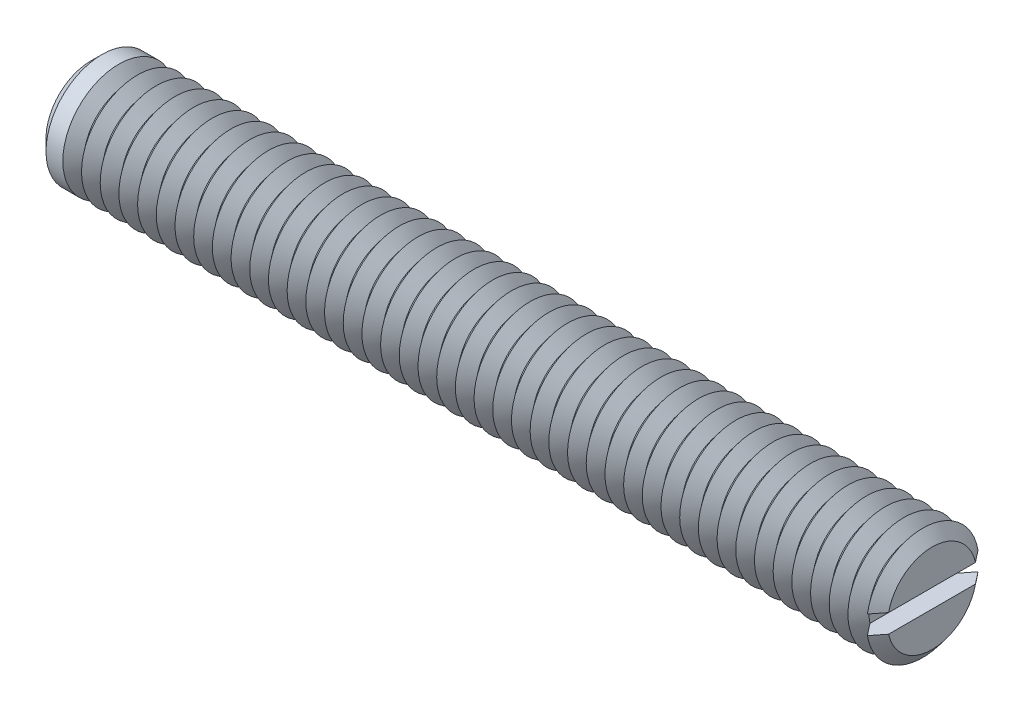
ISO-10303-21;
HEADER;
FILE_DESCRIPTION(('STEP AP214'),'2;1');
FILE_NAME('part.step','',(''),(''),'','','');
FILE_SCHEMA(('AUTOMOTIVE_DESIGN { 1 0 10303 214 1 1 1 1 }'));
ENDSEC;
DATA;
#1=APPLICATION_CONTEXT('core data for automotive mechanical design processes');
#2=APPLICATION_PROTOCOL_DEFINITION('international standard','automotive_design',2000,#1);
#3=PRODUCT_CONTEXT('',#1,'mechanical');
#4=PRODUCT('Part','Part','',(#3));
#5=PRODUCT_RELATED_PRODUCT_CATEGORY('part','',(#4));
#6=PRODUCT_DEFINITION_FORMATION('','',#4);
#7=PRODUCT_DEFINITION_CONTEXT('part definition',#1,'design');
#8=PRODUCT_DEFINITION('design','',#6,#7);
#9=PRODUCT_DEFINITION_SHAPE('','',#8);
#10=(LENGTH_UNIT() NAMED_UNIT(*) SI_UNIT(.MILLI.,.METRE.));
#11=(NAMED_UNIT(*) PLANE_ANGLE_UNIT() SI_UNIT($,.RADIAN.));
#12=(NAMED_UNIT(*) SI_UNIT($,.STERADIAN.) SOLID_ANGLE_UNIT());
#13=UNCERTAINTY_MEASURE_WITH_UNIT(LENGTH_MEASURE(1.E-05),#10,'distance_accuracy_value','');
#14=(GEOMETRIC_REPRESENTATION_CONTEXT(3) GLOBAL_UNCERTAINTY_ASSIGNED_CONTEXT((#13)) GLOBAL_UNIT_ASSIGNED_CONTEXT((#10,
#11,#12)) REPRESENTATION_CONTEXT('',''));
#15=CARTESIAN_POINT('',(0.,0.,0.));
#16=DIRECTION('',(0.,0.,1.));
#17=DIRECTION('',(1.,0.,0.));
#18=AXIS2_PLACEMENT_3D('',#15,#16,#17);
#19=CARTESIAN_POINT('',(22.,0.,0.));
#20=DIRECTION('',(1.,0.,0.));
#21=DIRECTION('',(0.,0.,-1.));
#22=AXIS2_PLACEMENT_3D('',#19,#20,#21);
#23=CONICAL_SURFACE('',#22,3.,0.895664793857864);
#24=CARTESIAN_POINT('',(22.,0.,0.));
#25=DIRECTION('',(-1.,0.,0.));
#26=DIRECTION('',(0.,0.,1.));
#27=AXIS2_PLACEMENT_3D('',#24,#25,#26);
#28=CIRCLE('',#27,3.);
#29=CARTESIAN_POINT('',(22.,-0.5,-2.95803989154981));
#30=VERTEX_POINT('',#29);
#31=CARTESIAN_POINT('',(22.,-0.5,2.95803989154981));
#32=VERTEX_POINT('',#31);
#33=EDGE_CURVE('E117',#30,#32,#28,.T.);
#34=ORIENTED_EDGE('',*,*,#33,.T.);
#35=CARTESIAN_POINT('',(24.8340158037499,-0.5,-6.52054251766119));
#36=CARTESIAN_POINT('',(24.6513674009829,-0.5,-6.29173953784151));
#37=CARTESIAN_POINT('',(24.4687482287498,-0.5,-6.0629132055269));
#38=CARTESIAN_POINT('',(24.1035782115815,-0.5,-5.60514706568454));
#39=CARTESIAN_POINT('',(23.9210273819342,-0.5,-5.37620724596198));
#40=CARTESIAN_POINT('',(23.5555297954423,-0.5,-4.91755222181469));
#41=CARTESIAN_POINT('',(23.3725834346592,-0.5,-4.6878367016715));
#42=CARTESIAN_POINT('',(23.0069310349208,-0.5,-4.22827290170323));
#43=CARTESIAN_POINT('',(22.8242249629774,-0.5,-3.99842464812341));
#44=CARTESIAN_POINT('',(22.4431833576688,-0.5,-3.51834247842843));
#45=CARTESIAN_POINT('',(22.244878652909,-0.5,-3.26808406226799));
#46=CARTESIAN_POINT('',(21.9479597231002,-0.5,-2.89216906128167));
#47=CARTESIAN_POINT('',(21.8490516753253,-0.5,-2.76674461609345));
#48=CARTESIAN_POINT('',(21.6515374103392,-0.5,-2.51567085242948));
#49=CARTESIAN_POINT('',(21.5529311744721,-0.5,-2.39002154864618));
#50=CARTESIAN_POINT('',(21.3563868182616,-0.5,-2.1386227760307));
#51=CARTESIAN_POINT('',(21.2584477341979,-0.5,-2.01287406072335));
#52=CARTESIAN_POINT('',(21.0633111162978,-0.5,-1.7607527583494));
#53=CARTESIAN_POINT('',(20.9661137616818,-0.5,-1.63438003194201));
#54=CARTESIAN_POINT('',(20.8214734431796,-0.5,-1.44403413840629));
#55=CARTESIAN_POINT('',(20.7734745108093,-0.5,-1.38048388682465));
#56=CARTESIAN_POINT('',(20.6780284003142,-0.5,-1.25297092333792));
#57=CARTESIAN_POINT('',(20.630581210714,-0.5,-1.18900822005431));
#58=CARTESIAN_POINT('',(20.5365530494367,-0.5,-1.0604855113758));
#59=CARTESIAN_POINT('',(20.4899717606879,-0.5,-0.995925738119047));
#60=CARTESIAN_POINT('',(20.3981961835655,-0.5,-0.865829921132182));
#61=CARTESIAN_POINT('',(20.3530016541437,-0.5,-0.800294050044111));
#62=CARTESIAN_POINT('',(20.2995678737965,-0.5,-0.719528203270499));
#63=CARTESIAN_POINT('',(20.2901114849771,-0.5,-0.705104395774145));
#64=CARTESIAN_POINT('',(20.2713420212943,-0.5,-0.676163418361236));
#65=CARTESIAN_POINT('',(20.262028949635,-0.5,-0.661646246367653));
#66=CARTESIAN_POINT('',(20.2343355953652,-0.5,-0.617935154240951));
#67=CARTESIAN_POINT('',(20.2162024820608,-0.5,-0.588583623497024));
#68=CARTESIAN_POINT('',(20.1808134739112,-0.5,-0.529281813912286));
#69=CARTESIAN_POINT('',(20.1635591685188,-0.5,-0.499330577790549));
#70=CARTESIAN_POINT('',(20.130358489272,-0.5,-0.438714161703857));
#71=CARTESIAN_POINT('',(20.1144119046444,-0.5,-0.408049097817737));
#72=CARTESIAN_POINT('',(20.0785841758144,-0.5,-0.333745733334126));
#73=CARTESIAN_POINT('',(20.0595664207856,-0.5,-0.289676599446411));
#74=CARTESIAN_POINT('',(20.0278600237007,-0.5,-0.199412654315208));
#75=CARTESIAN_POINT('',(20.0151365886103,-0.5,-0.153231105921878));
#76=CARTESIAN_POINT('',(20.001111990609,-0.5,-0.0687562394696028));
#77=CARTESIAN_POINT('',(19.998005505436,-0.5,-0.030783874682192));
#78=CARTESIAN_POINT('',(19.9988722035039,-0.5,0.0450573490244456));
#79=CARTESIAN_POINT('',(20.0028411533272,-0.5,0.0829262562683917));
#80=CARTESIAN_POINT('',(20.0147515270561,-0.5,0.146691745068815));
#81=CARTESIAN_POINT('',(20.0212166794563,-0.5,0.172890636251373));
#82=CARTESIAN_POINT('',(20.0365108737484,-0.5,0.224599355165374));
#83=CARTESIAN_POINT('',(20.0453416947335,-0.5,0.250108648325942));
#84=CARTESIAN_POINT('',(20.0648480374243,-0.5,0.300632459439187));
#85=CARTESIAN_POINT('',(20.0755378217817,-0.5,0.325641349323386));
#86=CARTESIAN_POINT('',(20.098235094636,-0.5,0.37503562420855));
#87=CARTESIAN_POINT('',(20.1102421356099,-0.5,0.399421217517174));
#88=CARTESIAN_POINT('',(20.150943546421,-0.5,0.478106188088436));
#89=CARTESIAN_POINT('',(20.1816009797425,-0.5,0.531380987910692));
#90=CARTESIAN_POINT('',(20.2454790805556,-0.5,0.636383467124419));
#91=CARTESIAN_POINT('',(20.2787021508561,-0.5,0.688109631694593));
#92=CARTESIAN_POINT('',(20.3467342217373,-0.5,0.790686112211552));
#93=CARTESIAN_POINT('',(20.3815468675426,-0.5,0.841534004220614));
#94=CARTESIAN_POINT('',(20.4520982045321,-0.5,0.942545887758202));
#95=CARTESIAN_POINT('',(20.487836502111,-0.5,0.992710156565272));
#96=CARTESIAN_POINT('',(20.5600131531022,-0.5,1.09268759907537));
#97=CARTESIAN_POINT('',(20.596452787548,-0.5,1.14249984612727));
#98=CARTESIAN_POINT('',(20.6697745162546,-0.5,1.24180476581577));
#99=CARTESIAN_POINT('',(20.7066566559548,-0.5,1.29129740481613));
#100=CARTESIAN_POINT('',(20.8176541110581,-0.5,1.439268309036));
#101=CARTESIAN_POINT('',(20.8922352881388,-0.5,1.53739673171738));
#102=CARTESIAN_POINT('',(21.047080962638,-0.5,1.73962858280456));
#103=CARTESIAN_POINT('',(21.1273934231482,-0.5,1.84369513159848));
#104=CARTESIAN_POINT('',(21.2885076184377,-0.5,2.05144913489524));
#105=CARTESIAN_POINT('',(21.3693093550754,-0.5,2.15513658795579));
#106=CARTESIAN_POINT('',(21.6121843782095,-0.5,2.46584176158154));
#107=CARTESIAN_POINT('',(21.7747224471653,-0.5,2.67249578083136));
#108=CARTESIAN_POINT('',(22.1005180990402,-0.5,3.0854888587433));
#109=CARTESIAN_POINT('',(22.2637761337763,-0.5,3.29182756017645));
#110=CARTESIAN_POINT('',(22.5906371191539,-0.5,3.70422676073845));
#111=CARTESIAN_POINT('',(22.7542400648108,-0.5,3.91028726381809));
#112=CARTESIAN_POINT('',(23.0774242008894,-0.5,4.31690950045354));
#113=CARTESIAN_POINT('',(23.2369999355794,-0.5,4.51747557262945));
#114=CARTESIAN_POINT('',(23.5562886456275,-0.5,4.91850000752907));
#115=CARTESIAN_POINT('',(23.7160016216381,-0.5,5.11895836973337));
#116=CARTESIAN_POINT('',(24.0353926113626,-0.5,5.51963619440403));
#117=CARTESIAN_POINT('',(24.1950705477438,-0.5,5.71985571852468));
#118=CARTESIAN_POINT('',(24.5144964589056,-0.5,6.12023723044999));
#119=CARTESIAN_POINT('',(24.6742444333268,-0.5,6.32039921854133));
#120=CARTESIAN_POINT('',(24.8340158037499,-0.5,6.52054251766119));
#121=B_SPLINE_CURVE_WITH_KNOTS('',3,(#35,#36,#37,#38,#39,#40,#41,#42,#43,#44,#45,#46,#47,#48,
#49,#50,#51,#52,#53,#54,#55,#56,#57,#58,#59,#60,#61,#62,#63,#64,#65,#66,#67,#68,#69,#70,#71,#72,
#73,#74,#75,#76,#77,#78,#79,#80,#81,#82,#83,#84,#85,#86,#87,#88,#89,#90,#91,#92,#93,#94,#95,#96,
#97,#98,#99,#100,#101,#102,#103,#104,#105,#106,#107,#108,#109,#110,#111,#112,#113,#114,#115,
#116,#117,#118,#119,#120),.UNSPECIFIED.,.F.,.F.,(4,2,2,2,2,2,2,2,2,2,2,2,2,2,2,2,2,2,2,2,2,2,2,
2,2,2,2,2,2,2,2,2,2,2,2,2,2,2,2,2,2,2,4),(0.,0.878294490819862,1.75672728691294,
2.63771941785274,3.51857435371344,4.47648054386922,4.95567426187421,5.43483773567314,
5.91300334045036,6.39128103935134,6.63019943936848,6.86911286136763,7.10793700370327,
7.34671939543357,7.39846053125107,7.45020282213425,7.55369448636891,7.65736712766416,
7.76102302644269,7.90476612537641,8.04770552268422,8.16137782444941,8.27498213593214,
8.35581399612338,8.43670681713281,8.51825011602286,8.59976579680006,8.78399479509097,
8.96839847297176,9.15324864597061,9.33802146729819,9.52317177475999,9.7083412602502,
10.0780963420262,10.472454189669,10.8668135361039,11.65555692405,12.4448978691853,
13.2342274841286,14.0031360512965,14.7720482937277,15.5403347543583,16.3086173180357),.UNSPECIFIED.);
#122=CARTESIAN_POINT('',(21.5,-0.5,2.32228361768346));
#123=VERTEX_POINT('',#122);
#124=EDGE_CURVE('E109',#123,#32,#121,.T.);
#125=ORIENTED_EDGE('',*,*,#124,.F.);
#126=CARTESIAN_POINT('',(21.5,0.,0.));
#127=DIRECTION('',(-1.,0.,0.));
#128=DIRECTION('',(0.,0.,1.));
#129=AXIS2_PLACEMENT_3D('',#126,#127,#128);
#130=CIRCLE('',#129,2.37550020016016);
#131=CARTESIAN_POINT('',(21.5,-0.5,-2.32228361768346));
#132=VERTEX_POINT('',#131);
#133=EDGE_CURVE('E567',#132,#123,#130,.T.);
#134=ORIENTED_EDGE('',*,*,#133,.F.);
#135=EDGE_CURVE('E58',#30,#132,#121,.T.);
#136=ORIENTED_EDGE('',*,*,#135,.F.);
#137=EDGE_LOOP('',(#34,#125,#134,#136));
#138=FACE_BOUND('',#137,.T.);
#139=ADVANCED_FACE('F37',(#138),#23,.T.);
#140=CARTESIAN_POINT('',(22.,0.5,2.95803989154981));
#141=VERTEX_POINT('',#140);
#142=CARTESIAN_POINT('',(22.,0.5,-2.95803989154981));
#143=VERTEX_POINT('',#142);
#144=EDGE_CURVE('E100',#141,#143,#28,.T.);
#145=ORIENTED_EDGE('',*,*,#144,.T.);
#146=CARTESIAN_POINT('',(24.8340158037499,0.5,6.52054251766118));
#147=CARTESIAN_POINT('',(24.6513674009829,0.5,6.29173953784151));
#148=CARTESIAN_POINT('',(24.4687482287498,0.5,6.06291320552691));
#149=CARTESIAN_POINT('',(24.1035782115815,0.5,5.60514706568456));
#150=CARTESIAN_POINT('',(23.9210273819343,0.5,5.37620724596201));
#151=CARTESIAN_POINT('',(23.5555297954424,0.5,4.91755222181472));
#152=CARTESIAN_POINT('',(23.3725834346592,0.5,4.68783670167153));
#153=CARTESIAN_POINT('',(23.0069310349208,0.5,4.22827290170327));
#154=CARTESIAN_POINT('',(22.8242249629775,0.5,3.99842464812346));
#155=CARTESIAN_POINT('',(22.4431833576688,0.5,3.51834247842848));
#156=CARTESIAN_POINT('',(22.2448786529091,0.5,3.26808406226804));
#157=CARTESIAN_POINT('',(21.9479597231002,0.5,2.89216906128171));
#158=CARTESIAN_POINT('',(21.8490516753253,0.5,2.76674461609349));
#159=CARTESIAN_POINT('',(21.6515374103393,0.5,2.51567085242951));
#160=CARTESIAN_POINT('',(21.5529311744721,0.5,2.39002154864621));
#161=CARTESIAN_POINT('',(21.3563868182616,0.5,2.13862277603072));
#162=CARTESIAN_POINT('',(21.2584477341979,0.5,2.01287406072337));
#163=CARTESIAN_POINT('',(21.0633111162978,0.5,1.76075275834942));
#164=CARTESIAN_POINT('',(20.9661137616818,0.5,1.63438003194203));
#165=CARTESIAN_POINT('',(20.8214734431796,0.5,1.4440341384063));
#166=CARTESIAN_POINT('',(20.7734745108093,0.5,1.38048388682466));
#167=CARTESIAN_POINT('',(20.6780284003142,0.5,1.25297092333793));
#168=CARTESIAN_POINT('',(20.630581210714,0.5,1.18900822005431));
#169=CARTESIAN_POINT('',(20.5365530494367,0.5,1.06048551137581));
#170=CARTESIAN_POINT('',(20.4899717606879,0.5,0.99592573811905));
#171=CARTESIAN_POINT('',(20.3981961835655,0.5,0.865829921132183));
#172=CARTESIAN_POINT('',(20.3530016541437,0.5,0.800294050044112));
#173=CARTESIAN_POINT('',(20.2995678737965,0.5,0.719528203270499));
#174=CARTESIAN_POINT('',(20.2901114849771,0.5,0.705104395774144));
#175=CARTESIAN_POINT('',(20.2713420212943,0.5,0.676163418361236));
#176=CARTESIAN_POINT('',(20.262028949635,0.5,0.661646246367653));
#177=CARTESIAN_POINT('',(20.2343355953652,0.5,0.61793515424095));
#178=CARTESIAN_POINT('',(20.2162024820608,0.5,0.588583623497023));
#179=CARTESIAN_POINT('',(20.1808134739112,0.5,0.529281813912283));
#180=CARTESIAN_POINT('',(20.1635591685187,0.5,0.499330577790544));
#181=CARTESIAN_POINT('',(20.130358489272,0.5,0.438714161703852));
#182=CARTESIAN_POINT('',(20.1144119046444,0.5,0.408049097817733));
#183=CARTESIAN_POINT('',(20.0785841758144,0.5,0.333745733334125));
#184=CARTESIAN_POINT('',(20.0595664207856,0.5,0.289676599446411));
#185=CARTESIAN_POINT('',(20.0278600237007,0.5,0.199412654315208));
#186=CARTESIAN_POINT('',(20.0151365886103,0.5,0.153231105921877));
#187=CARTESIAN_POINT('',(20.001111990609,0.5,0.0687562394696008));
#188=CARTESIAN_POINT('',(19.998005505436,0.5,0.0307838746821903));
#189=CARTESIAN_POINT('',(19.9988722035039,0.5,-0.0450573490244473));
#190=CARTESIAN_POINT('',(20.0028411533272,0.5,-0.0829262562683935));
#191=CARTESIAN_POINT('',(20.0147515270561,0.5,-0.146691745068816));
#192=CARTESIAN_POINT('',(20.0212166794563,0.5,-0.172890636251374));
#193=CARTESIAN_POINT('',(20.0365108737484,0.5,-0.224599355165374));
#194=CARTESIAN_POINT('',(20.0453416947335,0.5,-0.250108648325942));
#195=CARTESIAN_POINT('',(20.0648480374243,0.5,-0.300632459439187));
#196=CARTESIAN_POINT('',(20.0755378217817,0.5,-0.325641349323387));
#197=CARTESIAN_POINT('',(20.098235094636,0.5,-0.375035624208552));
#198=CARTESIAN_POINT('',(20.1102421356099,0.5,-0.399421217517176));
#199=CARTESIAN_POINT('',(20.150943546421,0.5,-0.478106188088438));
#200=CARTESIAN_POINT('',(20.1816009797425,0.5,-0.531380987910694));
#201=CARTESIAN_POINT('',(20.2454790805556,0.5,-0.636383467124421));
#202=CARTESIAN_POINT('',(20.2787021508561,0.5,-0.688109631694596));
#203=CARTESIAN_POINT('',(20.3467342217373,0.5,-0.790686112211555));
#204=CARTESIAN_POINT('',(20.3815468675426,0.5,-0.841534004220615));
#205=CARTESIAN_POINT('',(20.4520982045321,0.5,-0.942545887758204));
#206=CARTESIAN_POINT('',(20.487836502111,0.5,-0.992710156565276));
#207=CARTESIAN_POINT('',(20.5600131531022,0.5,-1.09268759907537));
#208=CARTESIAN_POINT('',(20.596452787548,0.5,-1.14249984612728));
#209=CARTESIAN_POINT('',(20.6697745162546,0.5,-1.24180476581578));
#210=CARTESIAN_POINT('',(20.7066566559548,0.5,-1.29129740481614));
#211=CARTESIAN_POINT('',(20.8176541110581,0.5,-1.43926830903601));
#212=CARTESIAN_POINT('',(20.8922352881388,0.5,-1.53739673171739));
#213=CARTESIAN_POINT('',(21.047080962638,0.5,-1.73962858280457));
#214=CARTESIAN_POINT('',(21.1273934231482,0.5,-1.84369513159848));
#215=CARTESIAN_POINT('',(21.2885076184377,0.5,-2.05144913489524));
#216=CARTESIAN_POINT('',(21.3693093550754,0.5,-2.1551365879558));
#217=CARTESIAN_POINT('',(21.6121843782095,0.5,-2.46584176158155));
#218=CARTESIAN_POINT('',(21.7747224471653,0.5,-2.67249578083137));
#219=CARTESIAN_POINT('',(22.1005180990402,0.5,-3.08548885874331));
#220=CARTESIAN_POINT('',(22.2637761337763,0.5,-3.29182756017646));
#221=CARTESIAN_POINT('',(22.5906371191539,0.5,-3.70422676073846));
#222=CARTESIAN_POINT('',(22.7542400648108,0.5,-3.9102872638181));
#223=CARTESIAN_POINT('',(23.0774242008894,0.5,-4.31690950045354));
#224=CARTESIAN_POINT('',(23.2369999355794,0.5,-4.51747557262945));
#225=CARTESIAN_POINT('',(23.5562886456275,0.5,-4.91850000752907));
#226=CARTESIAN_POINT('',(23.7160016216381,0.5,-5.11895836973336));
#227=CARTESIAN_POINT('',(24.0353926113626,0.5,-5.51963619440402));
#228=CARTESIAN_POINT('',(24.1950705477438,0.5,-5.71985571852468));
#229=CARTESIAN_POINT('',(24.5144964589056,0.5,-6.12023723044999));
#230=CARTESIAN_POINT('',(24.6742444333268,0.5,-6.32039921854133));
#231=CARTESIAN_POINT('',(24.8340158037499,0.5,-6.52054251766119));
#232=B_SPLINE_CURVE_WITH_KNOTS('',3,(#146,#147,#148,#149,#150,#151,#152,#153,#154,#155,#156,
#157,#158,#159,#160,#161,#162,#163,#164,#165,#166,#167,#168,#169,#170,#171,#172,#173,#174,#175,
#176,#177,#178,#179,#180,#181,#182,#183,#184,#185,#186,#187,#188,#189,#190,#191,#192,#193,#194,
#195,#196,#197,#198,#199,#200,#201,#202,#203,#204,#205,#206,#207,#208,#209,#210,#211,#212,#213,
#214,#215,#216,#217,#218,#219,#220,#221,#222,#223,#224,#225,#226,#227,#228,#229,#230,#231),
.UNSPECIFIED.,.F.,.F.,(4,2,2,2,2,2,2,2,2,2,2,2,2,2,2,2,2,2,2,2,2,2,2,2,2,2,2,2,2,2,2,2,2,2,2,2,
2,2,2,2,2,2,4),(0.,0.878294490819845,1.75672728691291,2.63771941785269,3.51857435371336,
4.47648054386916,4.95567426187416,5.4348377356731,5.91300334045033,6.39128103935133,
6.63019943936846,6.86911286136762,7.10793700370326,7.34671939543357,7.39846053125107,
7.45020282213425,7.55369448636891,7.65736712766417,7.76102302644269,7.90476612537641,
8.04770552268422,8.16137782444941,8.27498213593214,8.35581399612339,8.43670681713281,
8.51825011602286,8.59976579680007,8.78399479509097,8.96839847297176,9.15324864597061,
9.3380214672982,9.52317177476,9.70834126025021,10.0780963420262,10.472454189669,
10.8668135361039,11.65555692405,12.4448978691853,13.2342274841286,14.0031360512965,
14.7720482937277,15.5403347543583,16.3086173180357),.UNSPECIFIED.);
#233=CARTESIAN_POINT('',(21.5,0.5,-2.32228361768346));
#234=VERTEX_POINT('',#233);
#235=EDGE_CURVE('E110',#234,#143,#232,.T.);
#236=ORIENTED_EDGE('',*,*,#235,.F.);
#237=CARTESIAN_POINT('',(21.5,0.5,2.32228361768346));
#238=VERTEX_POINT('',#237);
#239=EDGE_CURVE('E103',#238,#234,#130,.T.);
#240=ORIENTED_EDGE('',*,*,#239,.F.);
#241=EDGE_CURVE('E97',#141,#238,#232,.T.);
#242=ORIENTED_EDGE('',*,*,#241,.F.);
#243=EDGE_LOOP('',(#145,#236,#240,#242));
#244=FACE_BOUND('',#243,.T.);
#245=ADVANCED_FACE('F99',(#244),#23,.T.);
#246=CARTESIAN_POINT('',(21.5,0.,0.));
#247=DIRECTION('',(-1.,0.,0.));
#248=DIRECTION('',(0.,0.,1.));
#249=AXIS2_PLACEMENT_3D('',#246,#247,#248);
#250=CONICAL_SURFACE('',#249,2.37550020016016,0.895664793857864);
#251=CARTESIAN_POINT('',(21.,0.,0.));
#252=DIRECTION('',(-1.,0.,0.));
#253=DIRECTION('',(0.,0.,1.));
#254=AXIS2_PLACEMENT_3D('',#251,#252,#253);
#255=CIRCLE('',#254,3.);
#256=CARTESIAN_POINT('',(21.,0.,3.));
#257=VERTEX_POINT('',#256);
#258=EDGE_CURVE('E554',#257,#257,#255,.T.);
#259=ORIENTED_EDGE('',*,*,#258,.F.);
#260=EDGE_LOOP('',(#259));
#261=FACE_BOUND('',#260,.T.);
#262=ORIENTED_EDGE('',*,*,#239,.T.);
#263=EDGE_CURVE('E561',#234,#132,#130,.T.);
#264=ORIENTED_EDGE('',*,*,#263,.T.);
#265=ORIENTED_EDGE('',*,*,#133,.T.);
#266=EDGE_CURVE('E560',#123,#238,#130,.T.);
#267=ORIENTED_EDGE('',*,*,#266,.T.);
#268=EDGE_LOOP('',(#262,#264,#265,#267));
#269=FACE_BOUND('',#268,.T.);
#270=ADVANCED_FACE('F167',(#261,#269),#250,.T.);
#271=CARTESIAN_POINT('',(22.5,0.,0.));
#272=DIRECTION('',(1.,0.,0.));
#273=DIRECTION('',(0.,0.,-1.));
#274=AXIS2_PLACEMENT_3D('',#271,#272,#273);
#275=PLANE('',#274);
#276=CARTESIAN_POINT('',(22.5,0.,0.));
#277=DIRECTION('',(-1.,0.,0.));
#278=DIRECTION('',(0.,0.,1.));
#279=AXIS2_PLACEMENT_3D('',#276,#277,#278);
#280=CIRCLE('',#279,2.37550020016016);
#281=CARTESIAN_POINT('',(22.5,0.5,2.32228361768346));
#282=VERTEX_POINT('',#281);
#283=CARTESIAN_POINT('',(22.5,0.5,-2.32228361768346));
#284=VERTEX_POINT('',#283);
#285=EDGE_CURVE('E159',#282,#284,#280,.T.);
#286=ORIENTED_EDGE('',*,*,#285,.F.);
#287=DIRECTION('',(0.,0.,1.));
#288=VECTOR('',#287,1.);
#289=CARTESIAN_POINT('',(22.5,0.5,0.));
#290=LINE('',#289,#288);
#291=EDGE_CURVE('E122',#284,#282,#290,.T.);
#292=ORIENTED_EDGE('',*,*,#291,.F.);
#293=EDGE_LOOP('',(#286,#292));
#294=FACE_BOUND('',#293,.T.);
#295=ADVANCED_FACE('F171',(#294),#275,.T.);
#296=CARTESIAN_POINT('',(22.5,-0.5,-2.32228361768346));
#297=VERTEX_POINT('',#296);
#298=CARTESIAN_POINT('',(22.5,-0.5,2.32228361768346));
#299=VERTEX_POINT('',#298);
#300=EDGE_CURVE('E66',#297,#299,#280,.T.);
#301=ORIENTED_EDGE('',*,*,#300,.F.);
#302=DIRECTION('',(0.,0.,-1.));
#303=VECTOR('',#302,1.);
#304=CARTESIAN_POINT('',(22.5,-0.5,0.));
#305=LINE('',#304,#303);
#306=EDGE_CURVE('E135',#299,#297,#305,.T.);
#307=ORIENTED_EDGE('',*,*,#306,.F.);
#308=EDGE_LOOP('',(#301,#307));
#309=FACE_BOUND('',#308,.T.);
#310=ADVANCED_FACE('F200',(#309),#275,.T.);
#311=CARTESIAN_POINT('',(22.5,0.,0.));
#312=DIRECTION('',(-1.,0.,0.));
#313=DIRECTION('',(0.,0.,1.));
#314=AXIS2_PLACEMENT_3D('',#311,#312,#313);
#315=CONICAL_SURFACE('',#314,2.37550020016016,0.895664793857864);
#316=ORIENTED_EDGE('',*,*,#144,.F.);
#317=CARTESIAN_POINT('',(19.1659841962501,0.5,-6.52054251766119));
#318=CARTESIAN_POINT('',(19.3486325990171,0.5,-6.29173953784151));
#319=CARTESIAN_POINT('',(19.5312517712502,0.5,-6.06291320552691));
#320=CARTESIAN_POINT('',(19.8964217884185,0.5,-5.60514706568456));
#321=CARTESIAN_POINT('',(20.0789726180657,0.5,-5.37620724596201));
#322=CARTESIAN_POINT('',(20.4444702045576,0.5,-4.91755222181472));
#323=CARTESIAN_POINT('',(20.6274165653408,0.5,-4.68783670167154));
#324=CARTESIAN_POINT('',(20.9930689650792,0.5,-4.22827290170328));
#325=CARTESIAN_POINT('',(21.1757750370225,0.5,-3.99842464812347));
#326=CARTESIAN_POINT('',(21.5568166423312,0.5,-3.51834247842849));
#327=CARTESIAN_POINT('',(21.7551213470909,0.5,-3.26808406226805));
#328=CARTESIAN_POINT('',(22.0520402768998,0.5,-2.89216906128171));
#329=CARTESIAN_POINT('',(22.1509483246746,0.5,-2.76674461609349));
#330=CARTESIAN_POINT('',(22.3484625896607,0.5,-2.51567085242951));
#331=CARTESIAN_POINT('',(22.4470688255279,0.5,-2.39002154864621));
#332=CARTESIAN_POINT('',(22.6436131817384,0.5,-2.13862277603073));
#333=CARTESIAN_POINT('',(22.7415522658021,0.5,-2.01287406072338));
#334=CARTESIAN_POINT('',(22.9366888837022,0.5,-1.76075275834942));
#335=CARTESIAN_POINT('',(23.0338862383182,0.5,-1.63438003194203));
#336=CARTESIAN_POINT('',(23.1785265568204,0.5,-1.44403413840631));
#337=CARTESIAN_POINT('',(23.2265254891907,0.5,-1.38048388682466));
#338=CARTESIAN_POINT('',(23.3219715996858,0.5,-1.25297092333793));
#339=CARTESIAN_POINT('',(23.369418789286,0.5,-1.18900822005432));
#340=CARTESIAN_POINT('',(23.4634469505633,0.5,-1.06048551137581));
#341=CARTESIAN_POINT('',(23.5100282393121,0.5,-0.995925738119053));
#342=CARTESIAN_POINT('',(23.6018038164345,0.5,-0.865829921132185));
#343=CARTESIAN_POINT('',(23.6469983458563,0.5,-0.800294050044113));
#344=CARTESIAN_POINT('',(23.7004321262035,0.5,-0.719528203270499));
#345=CARTESIAN_POINT('',(23.7098885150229,0.5,-0.705104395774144));
#346=CARTESIAN_POINT('',(23.7286579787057,0.5,-0.676163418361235));
#347=CARTESIAN_POINT('',(23.737971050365,0.5,-0.661646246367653));
#348=CARTESIAN_POINT('',(23.7656644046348,0.5,-0.61793515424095));
#349=CARTESIAN_POINT('',(23.7837975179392,0.5,-0.588583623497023));
#350=CARTESIAN_POINT('',(23.8191865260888,0.5,-0.529281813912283));
#351=CARTESIAN_POINT('',(23.8364408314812,0.5,-0.499330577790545));
#352=CARTESIAN_POINT('',(23.869641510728,0.5,-0.438714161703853));
#353=CARTESIAN_POINT('',(23.8855880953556,0.5,-0.408049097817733));
#354=CARTESIAN_POINT('',(23.9214158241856,0.5,-0.333745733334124));
#355=CARTESIAN_POINT('',(23.9404335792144,0.5,-0.289676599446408));
#356=CARTESIAN_POINT('',(23.9721399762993,0.5,-0.199412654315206));
#357=CARTESIAN_POINT('',(23.9848634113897,0.5,-0.153231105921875));
#358=CARTESIAN_POINT('',(23.998888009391,0.5,-0.0687562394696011));
#359=CARTESIAN_POINT('',(24.001994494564,0.5,-0.0307838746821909));
#360=CARTESIAN_POINT('',(24.0011277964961,0.5,0.0450573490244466));
#361=CARTESIAN_POINT('',(23.9971588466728,0.5,0.0829262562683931));
#362=CARTESIAN_POINT('',(23.9852484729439,0.5,0.146691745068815));
#363=CARTESIAN_POINT('',(23.9787833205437,0.5,0.172890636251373));
#364=CARTESIAN_POINT('',(23.9634891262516,0.5,0.224599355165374));
#365=CARTESIAN_POINT('',(23.9546583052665,0.5,0.250108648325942));
#366=CARTESIAN_POINT('',(23.9351519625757,0.5,0.300632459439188));
#367=CARTESIAN_POINT('',(23.9244621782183,0.5,0.325641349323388));
#368=CARTESIAN_POINT('',(23.901764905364,0.5,0.375035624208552));
#369=CARTESIAN_POINT('',(23.8897578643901,0.5,0.399421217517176));
#370=CARTESIAN_POINT('',(23.8490564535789,0.5,0.478106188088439));
#371=CARTESIAN_POINT('',(23.8183990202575,0.5,0.531380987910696));
#372=CARTESIAN_POINT('',(23.7545209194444,0.5,0.636383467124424));
#373=CARTESIAN_POINT('',(23.7212978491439,0.5,0.688109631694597));
#374=CARTESIAN_POINT('',(23.6532657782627,0.5,0.790686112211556));
#375=CARTESIAN_POINT('',(23.6184531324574,0.5,0.841534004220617));
#376=CARTESIAN_POINT('',(23.5479017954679,0.5,0.942545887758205));
#377=CARTESIAN_POINT('',(23.512163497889,0.5,0.992710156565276));
#378=CARTESIAN_POINT('',(23.4399868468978,0.5,1.09268759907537));
#379=CARTESIAN_POINT('',(23.403547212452,0.5,1.14249984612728));
#380=CARTESIAN_POINT('',(23.3302254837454,0.5,1.24180476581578));
#381=CARTESIAN_POINT('',(23.2933433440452,0.5,1.29129740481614));
#382=CARTESIAN_POINT('',(23.1823458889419,0.5,1.43926830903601));
#383=CARTESIAN_POINT('',(23.1077647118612,0.5,1.53739673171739));
#384=CARTESIAN_POINT('',(22.952919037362,0.5,1.73962858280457));
#385=CARTESIAN_POINT('',(22.8726065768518,0.5,1.84369513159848));
#386=CARTESIAN_POINT('',(22.7114923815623,0.5,2.05144913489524));
#387=CARTESIAN_POINT('',(22.6306906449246,0.5,2.1551365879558));
#388=CARTESIAN_POINT('',(22.3878156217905,0.5,2.46584176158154));
#389=CARTESIAN_POINT('',(22.2252775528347,0.5,2.67249578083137));
#390=CARTESIAN_POINT('',(21.8994819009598,0.5,3.0854888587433));
#391=CARTESIAN_POINT('',(21.7362238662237,0.5,3.29182756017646));
#392=CARTESIAN_POINT('',(21.4093628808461,0.5,3.70422676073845));
#393=CARTESIAN_POINT('',(21.2457599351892,0.5,3.9102872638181));
#394=CARTESIAN_POINT('',(20.9225757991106,0.5,4.31690950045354));
#395=CARTESIAN_POINT('',(20.7630000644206,0.5,4.51747557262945));
#396=CARTESIAN_POINT('',(20.4437113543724,0.5,4.91850000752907));
#397=CARTESIAN_POINT('',(20.2839983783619,0.5,5.11895836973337));
#398=CARTESIAN_POINT('',(19.9646073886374,0.5,5.51963619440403));
#399=CARTESIAN_POINT('',(19.8049294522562,0.5,5.71985571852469));
#400=CARTESIAN_POINT('',(19.4855035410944,0.5,6.12023723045));
#401=CARTESIAN_POINT('',(19.3257555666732,0.5,6.32039921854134));
#402=CARTESIAN_POINT('',(19.1659841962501,0.5,6.52054251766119));
#403=B_SPLINE_CURVE_WITH_KNOTS('',3,(#317,#318,#319,#320,#321,#322,#323,#324,#325,#326,#327,
#328,#329,#330,#331,#332,#333,#334,#335,#336,#337,#338,#339,#340,#341,#342,#343,#344,#345,#346,
#347,#348,#349,#350,#351,#352,#353,#354,#355,#356,#357,#358,#359,#360,#361,#362,#363,#364,#365,
#366,#367,#368,#369,#370,#371,#372,#373,#374,#375,#376,#377,#378,#379,#380,#381,#382,#383,#384,
#385,#386,#387,#388,#389,#390,#391,#392,#393,#394,#395,#396,#397,#398,#399,#400,#401,#402),
.UNSPECIFIED.,.F.,.F.,(4,2,2,2,2,2,2,2,2,2,2,2,2,2,2,2,2,2,2,2,2,2,2,2,2,2,2,2,2,2,2,2,2,2,2,2,
2,2,2,2,2,2,4),(0.,0.878294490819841,1.7567272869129,2.63771941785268,3.51857435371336,
4.47648054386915,4.95567426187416,5.4348377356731,5.91300334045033,6.39128103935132,
6.63019943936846,6.86911286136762,7.10793700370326,7.34671939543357,7.39846053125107,
7.45020282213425,7.55369448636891,7.65736712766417,7.7610230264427,7.90476612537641,
8.04770552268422,8.16137782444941,8.27498213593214,8.35581399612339,8.43670681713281,
8.51825011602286,8.59976579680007,8.78399479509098,8.96839847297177,9.15324864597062,
9.3380214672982,9.52317177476,9.70834126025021,10.0780963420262,10.472454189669,
10.8668135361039,11.65555692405,12.4448978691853,13.2342274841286,14.0031360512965,
14.7720482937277,15.5403347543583,16.3086173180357),.UNSPECIFIED.);
#404=EDGE_CURVE('E41',#282,#141,#403,.T.);
#405=ORIENTED_EDGE('',*,*,#404,.F.);
#406=ORIENTED_EDGE('',*,*,#285,.T.);
#407=EDGE_CURVE('E11',#143,#284,#403,.T.);
#408=ORIENTED_EDGE('',*,*,#407,.F.);
#409=EDGE_LOOP('',(#316,#405,#406,#408));
#410=FACE_BOUND('',#409,.T.);
#411=ADVANCED_FACE('F114',(#410),#315,.T.);
#412=CARTESIAN_POINT('',(22.5,0.5,-4.5));
#413=DIRECTION('',(0.,1.,0.));
#414=DIRECTION('',(0.,0.,1.));
#415=AXIS2_PLACEMENT_3D('',#412,#413,#414);
#416=PLANE('',#415);
#417=ORIENTED_EDGE('',*,*,#404,.T.);
#418=ORIENTED_EDGE('',*,*,#241,.T.);
#419=DIRECTION('',(0.,0.,1.));
#420=VECTOR('',#419,1.);
#421=CARTESIAN_POINT('',(21.5,0.5,-4.5));
#422=LINE('',#421,#420);
#423=EDGE_CURVE('E144',#234,#238,#422,.T.);
#424=ORIENTED_EDGE('',*,*,#423,.F.);
#425=ORIENTED_EDGE('',*,*,#235,.T.);
#426=ORIENTED_EDGE('',*,*,#407,.T.);
#427=ORIENTED_EDGE('',*,*,#291,.T.);
#428=EDGE_LOOP('',(#417,#418,#424,#425,#426,#427));
#429=FACE_BOUND('',#428,.T.);
#430=ADVANCED_FACE('F120',(#429),#416,.F.);
#431=ORIENTED_EDGE('',*,*,#33,.F.);
#432=CARTESIAN_POINT('',(19.1659841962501,-0.5,6.52054251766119));
#433=CARTESIAN_POINT('',(19.3486325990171,-0.5,6.29173953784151));
#434=CARTESIAN_POINT('',(19.5312517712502,-0.5,6.06291320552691));
#435=CARTESIAN_POINT('',(19.8964217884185,-0.5,5.60514706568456));
#436=CARTESIAN_POINT('',(20.0789726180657,-0.5,5.37620724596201));
#437=CARTESIAN_POINT('',(20.4444702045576,-0.5,4.91755222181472));
#438=CARTESIAN_POINT('',(20.6274165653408,-0.5,4.68783670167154));
#439=CARTESIAN_POINT('',(20.9930689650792,-0.5,4.22827290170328));
#440=CARTESIAN_POINT('',(21.1757750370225,-0.5,3.99842464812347));
#441=CARTESIAN_POINT('',(21.5568166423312,-0.5,3.51834247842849));
#442=CARTESIAN_POINT('',(21.7551213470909,-0.5,3.26808406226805));
#443=CARTESIAN_POINT('',(22.0520402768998,-0.5,2.89216906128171));
#444=CARTESIAN_POINT('',(22.1509483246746,-0.5,2.76674461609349));
#445=CARTESIAN_POINT('',(22.3484625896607,-0.5,2.51567085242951));
#446=CARTESIAN_POINT('',(22.4470688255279,-0.5,2.39002154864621));
#447=CARTESIAN_POINT('',(22.6436131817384,-0.5,2.13862277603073));
#448=CARTESIAN_POINT('',(22.7415522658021,-0.5,2.01287406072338));
#449=CARTESIAN_POINT('',(22.9366888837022,-0.5,1.76075275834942));
#450=CARTESIAN_POINT('',(23.0338862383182,-0.5,1.63438003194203));
#451=CARTESIAN_POINT('',(23.1785265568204,-0.5,1.44403413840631));
#452=CARTESIAN_POINT('',(23.2265254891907,-0.5,1.38048388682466));
#453=CARTESIAN_POINT('',(23.3219715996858,-0.5,1.25297092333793));
#454=CARTESIAN_POINT('',(23.369418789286,-0.5,1.18900822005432));
#455=CARTESIAN_POINT('',(23.4634469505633,-0.5,1.06048551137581));
#456=CARTESIAN_POINT('',(23.5100282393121,-0.5,0.995925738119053));
#457=CARTESIAN_POINT('',(23.6018038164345,-0.5,0.865829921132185));
#458=CARTESIAN_POINT('',(23.6469983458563,-0.5,0.800294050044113));
#459=CARTESIAN_POINT('',(23.7004321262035,-0.5,0.719528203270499));
#460=CARTESIAN_POINT('',(23.7098885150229,-0.5,0.705104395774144));
#461=CARTESIAN_POINT('',(23.7286579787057,-0.5,0.676163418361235));
#462=CARTESIAN_POINT('',(23.737971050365,-0.5,0.661646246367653));
#463=CARTESIAN_POINT('',(23.7656644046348,-0.5,0.61793515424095));
#464=CARTESIAN_POINT('',(23.7837975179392,-0.5,0.588583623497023));
#465=CARTESIAN_POINT('',(23.8191865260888,-0.5,0.529281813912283));
#466=CARTESIAN_POINT('',(23.8364408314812,-0.5,0.499330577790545));
#467=CARTESIAN_POINT('',(23.869641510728,-0.5,0.438714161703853));
#468=CARTESIAN_POINT('',(23.8855880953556,-0.5,0.408049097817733));
#469=CARTESIAN_POINT('',(23.9214158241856,-0.5,0.333745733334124));
#470=CARTESIAN_POINT('',(23.9404335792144,-0.5,0.289676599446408));
#471=CARTESIAN_POINT('',(23.9721399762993,-0.5,0.199412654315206));
#472=CARTESIAN_POINT('',(23.9848634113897,-0.5,0.153231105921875));
#473=CARTESIAN_POINT('',(23.998888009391,-0.5,0.0687562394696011));
#474=CARTESIAN_POINT('',(24.001994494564,-0.5,0.0307838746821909));
#475=CARTESIAN_POINT('',(24.0011277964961,-0.5,-0.0450573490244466));
#476=CARTESIAN_POINT('',(23.9971588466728,-0.5,-0.0829262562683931));
#477=CARTESIAN_POINT('',(23.9852484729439,-0.5,-0.146691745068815));
#478=CARTESIAN_POINT('',(23.9787833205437,-0.5,-0.172890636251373));
#479=CARTESIAN_POINT('',(23.9634891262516,-0.5,-0.224599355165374));
#480=CARTESIAN_POINT('',(23.9546583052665,-0.5,-0.250108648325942));
#481=CARTESIAN_POINT('',(23.9351519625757,-0.5,-0.300632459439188));
#482=CARTESIAN_POINT('',(23.9244621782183,-0.5,-0.325641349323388));
#483=CARTESIAN_POINT('',(23.901764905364,-0.5,-0.375035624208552));
#484=CARTESIAN_POINT('',(23.8897578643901,-0.5,-0.399421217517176));
#485=CARTESIAN_POINT('',(23.8490564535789,-0.5,-0.478106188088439));
#486=CARTESIAN_POINT('',(23.8183990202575,-0.5,-0.531380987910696));
#487=CARTESIAN_POINT('',(23.7545209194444,-0.5,-0.636383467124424));
#488=CARTESIAN_POINT('',(23.7212978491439,-0.5,-0.688109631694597));
#489=CARTESIAN_POINT('',(23.6532657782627,-0.5,-0.790686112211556));
#490=CARTESIAN_POINT('',(23.6184531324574,-0.5,-0.841534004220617));
#491=CARTESIAN_POINT('',(23.5479017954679,-0.5,-0.942545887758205));
#492=CARTESIAN_POINT('',(23.512163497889,-0.5,-0.992710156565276));
#493=CARTESIAN_POINT('',(23.4399868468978,-0.5,-1.09268759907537));
#494=CARTESIAN_POINT('',(23.403547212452,-0.5,-1.14249984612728));
#495=CARTESIAN_POINT('',(23.3302254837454,-0.5,-1.24180476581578));
#496=CARTESIAN_POINT('',(23.2933433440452,-0.5,-1.29129740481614));
#497=CARTESIAN_POINT('',(23.1823458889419,-0.5,-1.43926830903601));
#498=CARTESIAN_POINT('',(23.1077647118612,-0.5,-1.53739673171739));
#499=CARTESIAN_POINT('',(22.952919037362,-0.5,-1.73962858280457));
#500=CARTESIAN_POINT('',(22.8726065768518,-0.5,-1.84369513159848));
#501=CARTESIAN_POINT('',(22.7114923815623,-0.5,-2.05144913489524));
#502=CARTESIAN_POINT('',(22.6306906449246,-0.5,-2.1551365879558));
#503=CARTESIAN_POINT('',(22.3878156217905,-0.5,-2.46584176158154));
#504=CARTESIAN_POINT('',(22.2252775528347,-0.5,-2.67249578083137));
#505=CARTESIAN_POINT('',(21.8994819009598,-0.5,-3.0854888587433));
#506=CARTESIAN_POINT('',(21.7362238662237,-0.5,-3.29182756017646));
#507=CARTESIAN_POINT('',(21.4093628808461,-0.5,-3.70422676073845));
#508=CARTESIAN_POINT('',(21.2457599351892,-0.5,-3.9102872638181));
#509=CARTESIAN_POINT('',(20.9225757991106,-0.5,-4.31690950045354));
#510=CARTESIAN_POINT('',(20.7630000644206,-0.5,-4.51747557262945));
#511=CARTESIAN_POINT('',(20.4437113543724,-0.5,-4.91850000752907));
#512=CARTESIAN_POINT('',(20.2839983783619,-0.5,-5.11895836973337));
#513=CARTESIAN_POINT('',(19.9646073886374,-0.5,-5.51963619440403));
#514=CARTESIAN_POINT('',(19.8049294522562,-0.5,-5.71985571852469));
#515=CARTESIAN_POINT('',(19.4855035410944,-0.5,-6.12023723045));
#516=CARTESIAN_POINT('',(19.3257555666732,-0.5,-6.32039921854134));
#517=CARTESIAN_POINT('',(19.1659841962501,-0.5,-6.52054251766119));
#518=B_SPLINE_CURVE_WITH_KNOTS('',3,(#432,#433,#434,#435,#436,#437,#438,#439,#440,#441,#442,
#443,#444,#445,#446,#447,#448,#449,#450,#451,#452,#453,#454,#455,#456,#457,#458,#459,#460,#461,
#462,#463,#464,#465,#466,#467,#468,#469,#470,#471,#472,#473,#474,#475,#476,#477,#478,#479,#480,
#481,#482,#483,#484,#485,#486,#487,#488,#489,#490,#491,#492,#493,#494,#495,#496,#497,#498,#499,
#500,#501,#502,#503,#504,#505,#506,#507,#508,#509,#510,#511,#512,#513,#514,#515,#516,#517),
.UNSPECIFIED.,.F.,.F.,(4,2,2,2,2,2,2,2,2,2,2,2,2,2,2,2,2,2,2,2,2,2,2,2,2,2,2,2,2,2,2,2,2,2,2,2,
2,2,2,2,2,2,4),(0.,0.878294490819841,1.7567272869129,2.63771941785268,3.51857435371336,
4.47648054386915,4.95567426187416,5.4348377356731,5.91300334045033,6.39128103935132,
6.63019943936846,6.86911286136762,7.10793700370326,7.34671939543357,7.39846053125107,
7.45020282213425,7.55369448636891,7.65736712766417,7.7610230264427,7.90476612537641,
8.04770552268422,8.16137782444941,8.27498213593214,8.35581399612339,8.43670681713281,
8.51825011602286,8.59976579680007,8.78399479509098,8.96839847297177,9.15324864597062,
9.3380214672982,9.52317177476,9.70834126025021,10.0780963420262,10.472454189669,
10.8668135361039,11.65555692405,12.4448978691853,13.2342274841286,14.0031360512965,
14.7720482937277,15.5403347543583,16.3086173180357),.UNSPECIFIED.);
#519=EDGE_CURVE('E151',#297,#30,#518,.T.);
#520=ORIENTED_EDGE('',*,*,#519,.F.);
#521=ORIENTED_EDGE('',*,*,#300,.T.);
#522=EDGE_CURVE('E147',#32,#299,#518,.T.);
#523=ORIENTED_EDGE('',*,*,#522,.F.);
#524=EDGE_LOOP('',(#431,#520,#521,#523));
#525=FACE_BOUND('',#524,.T.);
#526=ADVANCED_FACE('F163',(#525),#315,.T.);
#527=CARTESIAN_POINT('',(22.5,-0.5,-4.5));
#528=DIRECTION('',(0.,-1.,0.));
#529=DIRECTION('',(0.,0.,-1.));
#530=AXIS2_PLACEMENT_3D('',#527,#528,#529);
#531=PLANE('',#530);
#532=ORIENTED_EDGE('',*,*,#519,.T.);
#533=ORIENTED_EDGE('',*,*,#135,.T.);
#534=DIRECTION('',(0.,0.,1.));
#535=VECTOR('',#534,1.);
#536=CARTESIAN_POINT('',(21.5,-0.5,-4.5));
#537=LINE('',#536,#535);
#538=EDGE_CURVE('E143',#132,#123,#537,.T.);
#539=ORIENTED_EDGE('',*,*,#538,.T.);
#540=ORIENTED_EDGE('',*,*,#124,.T.);
#541=ORIENTED_EDGE('',*,*,#522,.T.);
#542=ORIENTED_EDGE('',*,*,#306,.T.);
#543=EDGE_LOOP('',(#532,#533,#539,#540,#541,#542));
#544=FACE_BOUND('',#543,.T.);
#545=ADVANCED_FACE('F160',(#544),#531,.F.);
#546=CARTESIAN_POINT('',(21.5,0.5,-4.5));
#547=DIRECTION('',(-1.,0.,0.));
#548=DIRECTION('',(0.,0.,1.));
#549=AXIS2_PLACEMENT_3D('',#546,#547,#548);
#550=PLANE('',#549);
#551=ORIENTED_EDGE('',*,*,#538,.F.);
#552=ORIENTED_EDGE('',*,*,#263,.F.);
#553=ORIENTED_EDGE('',*,*,#423,.T.);
#554=ORIENTED_EDGE('',*,*,#266,.F.);
#555=EDGE_LOOP('',(#551,#552,#553,#554));
#556=FACE_BOUND('',#555,.T.);
#557=ADVANCED_FACE('F573',(#556),#550,.F.);
#558=CARTESIAN_POINT('',(20.5,0.,0.));
#559=DIRECTION('',(-1.,0.,0.));
#560=DIRECTION('',(0.,0.,1.));
#561=AXIS2_PLACEMENT_3D('',#558,#559,#560);
#562=CONICAL_SURFACE('',#561,2.37550020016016,0.895664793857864);
#563=CARTESIAN_POINT('',(20.,0.,0.));
#564=DIRECTION('',(-1.,0.,0.));
#565=DIRECTION('',(0.,0.,1.));
#566=AXIS2_PLACEMENT_3D('',#563,#564,#565);
#567=CIRCLE('',#566,3.);
#568=CARTESIAN_POINT('',(20.,0.,3.));
#569=VERTEX_POINT('',#568);
#570=EDGE_CURVE('E547',#569,#569,#567,.T.);
#571=ORIENTED_EDGE('',*,*,#570,.F.);
#572=EDGE_LOOP('',(#571));
#573=FACE_BOUND('',#572,.T.);
#574=CARTESIAN_POINT('',(20.5,0.,0.));
#575=DIRECTION('',(-1.,0.,0.));
#576=DIRECTION('',(0.,0.,1.));
#577=AXIS2_PLACEMENT_3D('',#574,#575,#576);
#578=CIRCLE('',#577,2.37550020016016);
#579=CARTESIAN_POINT('',(20.5,0.,2.37550020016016));
#580=VERTEX_POINT('',#579);
#581=EDGE_CURVE('E557',#580,#580,#578,.T.);
#582=ORIENTED_EDGE('',*,*,#581,.T.);
#583=EDGE_LOOP('',(#582));
#584=FACE_BOUND('',#583,.T.);
#585=ADVANCED_FACE('F176',(#573,#584),#562,.T.);
#586=CARTESIAN_POINT('',(21.,0.,0.));
#587=DIRECTION('',(1.,0.,0.));
#588=DIRECTION('',(0.,0.,-1.));
#589=AXIS2_PLACEMENT_3D('',#586,#587,#588);
#590=CONICAL_SURFACE('',#589,3.,0.895664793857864);
#591=ORIENTED_EDGE('',*,*,#581,.F.);
#592=EDGE_LOOP('',(#591));
#593=FACE_BOUND('',#592,.T.);
#594=ORIENTED_EDGE('',*,*,#258,.T.);
#595=EDGE_LOOP('',(#594));
#596=FACE_BOUND('',#595,.T.);
#597=ADVANCED_FACE('F579',(#593,#596),#590,.T.);
#598=CARTESIAN_POINT('',(19.5,0.,0.));
#599=DIRECTION('',(-1.,0.,0.));
#600=DIRECTION('',(0.,0.,1.));
#601=AXIS2_PLACEMENT_3D('',#598,#599,#600);
#602=CONICAL_SURFACE('',#601,2.37550020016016,0.895664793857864);
#603=CARTESIAN_POINT('',(19.,0.,0.));
#604=DIRECTION('',(-1.,0.,0.));
#605=DIRECTION('',(0.,0.,1.));
#606=AXIS2_PLACEMENT_3D('',#603,#604,#605);
#607=CIRCLE('',#606,3.);
#608=CARTESIAN_POINT('',(19.,0.,3.));
#609=VERTEX_POINT('',#608);
#610=EDGE_CURVE('E539',#609,#609,#607,.T.);
#611=ORIENTED_EDGE('',*,*,#610,.F.);
#612=EDGE_LOOP('',(#611));
#613=FACE_BOUND('',#612,.T.);
#614=CARTESIAN_POINT('',(19.5,0.,0.));
#615=DIRECTION('',(-1.,0.,0.));
#616=DIRECTION('',(0.,0.,1.));
#617=AXIS2_PLACEMENT_3D('',#614,#615,#616);
#618=CIRCLE('',#617,2.37550020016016);
#619=CARTESIAN_POINT('',(19.5,0.,2.37550020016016));
#620=VERTEX_POINT('',#619);
#621=EDGE_CURVE('E550',#620,#620,#618,.T.);
#622=ORIENTED_EDGE('',*,*,#621,.T.);
#623=EDGE_LOOP('',(#622));
#624=FACE_BOUND('',#623,.T.);
#625=ADVANCED_FACE('F643',(#613,#624),#602,.T.);
#626=CARTESIAN_POINT('',(20.,0.,0.));
#627=DIRECTION('',(1.,0.,0.));
#628=DIRECTION('',(0.,0.,-1.));
#629=AXIS2_PLACEMENT_3D('',#626,#627,#628);
#630=CONICAL_SURFACE('',#629,3.,0.895664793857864);
#631=ORIENTED_EDGE('',*,*,#621,.F.);
#632=EDGE_LOOP('',(#631));
#633=FACE_BOUND('',#632,.T.);
#634=ORIENTED_EDGE('',*,*,#570,.T.);
#635=EDGE_LOOP('',(#634));
#636=FACE_BOUND('',#635,.T.);
#637=ADVANCED_FACE('F652',(#633,#636),#630,.T.);
#638=CARTESIAN_POINT('',(18.5,0.,0.));
#639=DIRECTION('',(-1.,0.,0.));
#640=DIRECTION('',(0.,0.,1.));
#641=AXIS2_PLACEMENT_3D('',#638,#639,#640);
#642=CONICAL_SURFACE('',#641,2.37550020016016,0.895664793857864);
#643=CARTESIAN_POINT('',(18.,0.,0.));
#644=DIRECTION('',(-1.,0.,0.));
#645=DIRECTION('',(0.,0.,1.));
#646=AXIS2_PLACEMENT_3D('',#643,#644,#645);
#647=CIRCLE('',#646,3.);
#648=CARTESIAN_POINT('',(18.,0.,3.));
#649=VERTEX_POINT('',#648);
#650=EDGE_CURVE('E532',#649,#649,#647,.T.);
#651=ORIENTED_EDGE('',*,*,#650,.F.);
#652=EDGE_LOOP('',(#651));
#653=FACE_BOUND('',#652,.T.);
#654=CARTESIAN_POINT('',(18.5,0.,0.));
#655=DIRECTION('',(-1.,0.,0.));
#656=DIRECTION('',(0.,0.,1.));
#657=AXIS2_PLACEMENT_3D('',#654,#655,#656);
#658=CIRCLE('',#657,2.37550020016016);
#659=CARTESIAN_POINT('',(18.5,0.,2.37550020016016));
#660=VERTEX_POINT('',#659);
#661=EDGE_CURVE('E543',#660,#660,#658,.T.);
#662=ORIENTED_EDGE('',*,*,#661,.T.);
#663=EDGE_LOOP('',(#662));
#664=FACE_BOUND('',#663,.T.);
#665=ADVANCED_FACE('F662',(#653,#664),#642,.T.);
#666=CARTESIAN_POINT('',(19.,0.,0.));
#667=DIRECTION('',(1.,0.,0.));
#668=DIRECTION('',(0.,0.,-1.));
#669=AXIS2_PLACEMENT_3D('',#666,#667,#668);
#670=CONICAL_SURFACE('',#669,3.,0.895664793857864);
#671=ORIENTED_EDGE('',*,*,#661,.F.);
#672=EDGE_LOOP('',(#671));
#673=FACE_BOUND('',#672,.T.);
#674=ORIENTED_EDGE('',*,*,#610,.T.);
#675=EDGE_LOOP('',(#674));
#676=FACE_BOUND('',#675,.T.);
#677=ADVANCED_FACE('F672',(#673,#676),#670,.T.);
#678=CARTESIAN_POINT('',(17.5,0.,0.));
#679=DIRECTION('',(-1.,0.,0.));
#680=DIRECTION('',(0.,0.,1.));
#681=AXIS2_PLACEMENT_3D('',#678,#679,#680);
#682=CONICAL_SURFACE('',#681,2.37550020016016,0.895664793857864);
#683=CARTESIAN_POINT('',(17.,0.,0.));
#684=DIRECTION('',(-1.,0.,0.));
#685=DIRECTION('',(0.,0.,1.));
#686=AXIS2_PLACEMENT_3D('',#683,#684,#685);
#687=CIRCLE('',#686,3.);
#688=CARTESIAN_POINT('',(17.,0.,3.));
#689=VERTEX_POINT('',#688);
#690=EDGE_CURVE('E525',#689,#689,#687,.T.);
#691=ORIENTED_EDGE('',*,*,#690,.F.);
#692=EDGE_LOOP('',(#691));
#693=FACE_BOUND('',#692,.T.);
#694=CARTESIAN_POINT('',(17.5,0.,0.));
#695=DIRECTION('',(-1.,0.,0.));
#696=DIRECTION('',(0.,0.,1.));
#697=AXIS2_PLACEMENT_3D('',#694,#695,#696);
#698=CIRCLE('',#697,2.37550020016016);
#699=CARTESIAN_POINT('',(17.5,0.,2.37550020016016));
#700=VERTEX_POINT('',#699);
#701=EDGE_CURVE('E536',#700,#700,#698,.T.);
#702=ORIENTED_EDGE('',*,*,#701,.T.);
#703=EDGE_LOOP('',(#702));
#704=FACE_BOUND('',#703,.T.);
#705=ADVANCED_FACE('F682',(#693,#704),#682,.T.);
#706=CARTESIAN_POINT('',(18.,0.,0.));
#707=DIRECTION('',(1.,0.,0.));
#708=DIRECTION('',(0.,0.,-1.));
#709=AXIS2_PLACEMENT_3D('',#706,#707,#708);
#710=CONICAL_SURFACE('',#709,3.,0.895664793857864);
#711=ORIENTED_EDGE('',*,*,#701,.F.);
#712=EDGE_LOOP('',(#711));
#713=FACE_BOUND('',#712,.T.);
#714=ORIENTED_EDGE('',*,*,#650,.T.);
#715=EDGE_LOOP('',(#714));
#716=FACE_BOUND('',#715,.T.);
#717=ADVANCED_FACE('F692',(#713,#716),#710,.T.);
#718=CARTESIAN_POINT('',(16.5,0.,0.));
#719=DIRECTION('',(-1.,0.,0.));
#720=DIRECTION('',(0.,0.,1.));
#721=AXIS2_PLACEMENT_3D('',#718,#719,#720);
#722=CONICAL_SURFACE('',#721,2.37550020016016,0.895664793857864);
#723=CARTESIAN_POINT('',(16.,0.,0.));
#724=DIRECTION('',(-1.,0.,0.));
#725=DIRECTION('',(0.,0.,1.));
#726=AXIS2_PLACEMENT_3D('',#723,#724,#725);
#727=CIRCLE('',#726,3.);
#728=CARTESIAN_POINT('',(16.,0.,3.));
#729=VERTEX_POINT('',#728);
#730=EDGE_CURVE('E517',#729,#729,#727,.T.);
#731=ORIENTED_EDGE('',*,*,#730,.F.);
#732=EDGE_LOOP('',(#731));
#733=FACE_BOUND('',#732,.T.);
#734=CARTESIAN_POINT('',(16.5,0.,0.));
#735=DIRECTION('',(-1.,0.,0.));
#736=DIRECTION('',(0.,0.,1.));
#737=AXIS2_PLACEMENT_3D('',#734,#735,#736);
#738=CIRCLE('',#737,2.37550020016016);
#739=CARTESIAN_POINT('',(16.5,0.,2.37550020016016));
#740=VERTEX_POINT('',#739);
#741=EDGE_CURVE('E529',#740,#740,#738,.T.);
#742=ORIENTED_EDGE('',*,*,#741,.T.);
#743=EDGE_LOOP('',(#742));
#744=FACE_BOUND('',#743,.T.);
#745=ADVANCED_FACE('F702',(#733,#744),#722,.T.);
#746=CARTESIAN_POINT('',(17.,0.,0.));
#747=DIRECTION('',(1.,0.,0.));
#748=DIRECTION('',(0.,0.,-1.));
#749=AXIS2_PLACEMENT_3D('',#746,#747,#748);
#750=CONICAL_SURFACE('',#749,3.,0.895664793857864);
#751=ORIENTED_EDGE('',*,*,#741,.F.);
#752=EDGE_LOOP('',(#751));
#753=FACE_BOUND('',#752,.T.);
#754=ORIENTED_EDGE('',*,*,#690,.T.);
#755=EDGE_LOOP('',(#754));
#756=FACE_BOUND('',#755,.T.);
#757=ADVANCED_FACE('F712',(#753,#756),#750,.T.);
#758=CARTESIAN_POINT('',(15.5,0.,0.));
#759=DIRECTION('',(-1.,0.,0.));
#760=DIRECTION('',(0.,0.,1.));
#761=AXIS2_PLACEMENT_3D('',#758,#759,#760);
#762=CONICAL_SURFACE('',#761,2.37550020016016,0.895664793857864);
#763=CARTESIAN_POINT('',(15.,0.,0.));
#764=DIRECTION('',(-1.,0.,0.));
#765=DIRECTION('',(0.,0.,1.));
#766=AXIS2_PLACEMENT_3D('',#763,#764,#765);
#767=CIRCLE('',#766,3.);
#768=CARTESIAN_POINT('',(15.,0.,3.));
#769=VERTEX_POINT('',#768);
#770=EDGE_CURVE('E509',#769,#769,#767,.T.);
#771=ORIENTED_EDGE('',*,*,#770,.F.);
#772=EDGE_LOOP('',(#771));
#773=FACE_BOUND('',#772,.T.);
#774=CARTESIAN_POINT('',(15.5,0.,0.));
#775=DIRECTION('',(-1.,0.,0.));
#776=DIRECTION('',(0.,0.,1.));
#777=AXIS2_PLACEMENT_3D('',#774,#775,#776);
#778=CIRCLE('',#777,2.37550020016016);
#779=CARTESIAN_POINT('',(15.5,0.,2.37550020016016));
#780=VERTEX_POINT('',#779);
#781=EDGE_CURVE('E521',#780,#780,#778,.T.);
#782=ORIENTED_EDGE('',*,*,#781,.T.);
#783=EDGE_LOOP('',(#782));
#784=FACE_BOUND('',#783,.T.);
#785=ADVANCED_FACE('F722',(#773,#784),#762,.T.);
#786=CARTESIAN_POINT('',(16.,0.,0.));
#787=DIRECTION('',(1.,0.,0.));
#788=DIRECTION('',(0.,0.,-1.));
#789=AXIS2_PLACEMENT_3D('',#786,#787,#788);
#790=CONICAL_SURFACE('',#789,3.,0.895664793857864);
#791=ORIENTED_EDGE('',*,*,#781,.F.);
#792=EDGE_LOOP('',(#791));
#793=FACE_BOUND('',#792,.T.);
#794=ORIENTED_EDGE('',*,*,#730,.T.);
#795=EDGE_LOOP('',(#794));
#796=FACE_BOUND('',#795,.T.);
#797=ADVANCED_FACE('F732',(#793,#796),#790,.T.);
#798=CARTESIAN_POINT('',(14.5,0.,0.));
#799=DIRECTION('',(-1.,0.,0.));
#800=DIRECTION('',(0.,0.,1.));
#801=AXIS2_PLACEMENT_3D('',#798,#799,#800);
#802=CONICAL_SURFACE('',#801,2.37550020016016,0.895664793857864);
#803=CARTESIAN_POINT('',(14.,0.,0.));
#804=DIRECTION('',(-1.,0.,0.));
#805=DIRECTION('',(0.,0.,1.));
#806=AXIS2_PLACEMENT_3D('',#803,#804,#805);
#807=CIRCLE('',#806,3.);
#808=CARTESIAN_POINT('',(14.,0.,3.));
#809=VERTEX_POINT('',#808);
#810=EDGE_CURVE('E501',#809,#809,#807,.T.);
#811=ORIENTED_EDGE('',*,*,#810,.F.);
#812=EDGE_LOOP('',(#811));
#813=FACE_BOUND('',#812,.T.);
#814=CARTESIAN_POINT('',(14.5,0.,0.));
#815=DIRECTION('',(-1.,0.,0.));
#816=DIRECTION('',(0.,0.,1.));
#817=AXIS2_PLACEMENT_3D('',#814,#815,#816);
#818=CIRCLE('',#817,2.37550020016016);
#819=CARTESIAN_POINT('',(14.5,0.,2.37550020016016));
#820=VERTEX_POINT('',#819);
#821=EDGE_CURVE('E513',#820,#820,#818,.T.);
#822=ORIENTED_EDGE('',*,*,#821,.T.);
#823=EDGE_LOOP('',(#822));
#824=FACE_BOUND('',#823,.T.);
#825=ADVANCED_FACE('F742',(#813,#824),#802,.T.);
#826=CARTESIAN_POINT('',(15.,0.,0.));
#827=DIRECTION('',(1.,0.,0.));
#828=DIRECTION('',(0.,0.,-1.));
#829=AXIS2_PLACEMENT_3D('',#826,#827,#828);
#830=CONICAL_SURFACE('',#829,3.,0.895664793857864);
#831=ORIENTED_EDGE('',*,*,#821,.F.);
#832=EDGE_LOOP('',(#831));
#833=FACE_BOUND('',#832,.T.);
#834=ORIENTED_EDGE('',*,*,#770,.T.);
#835=EDGE_LOOP('',(#834));
#836=FACE_BOUND('',#835,.T.);
#837=ADVANCED_FACE('F752',(#833,#836),#830,.T.);
#838=CARTESIAN_POINT('',(13.5,0.,0.));
#839=DIRECTION('',(-1.,0.,0.));
#840=DIRECTION('',(0.,0.,1.));
#841=AXIS2_PLACEMENT_3D('',#838,#839,#840);
#842=CONICAL_SURFACE('',#841,2.37550020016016,0.895664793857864);
#843=CARTESIAN_POINT('',(13.,0.,0.));
#844=DIRECTION('',(-1.,0.,0.));
#845=DIRECTION('',(0.,0.,1.));
#846=AXIS2_PLACEMENT_3D('',#843,#844,#845);
#847=CIRCLE('',#846,3.);
#848=CARTESIAN_POINT('',(13.,0.,3.));
#849=VERTEX_POINT('',#848);
#850=EDGE_CURVE('E493',#849,#849,#847,.T.);
#851=ORIENTED_EDGE('',*,*,#850,.F.);
#852=EDGE_LOOP('',(#851));
#853=FACE_BOUND('',#852,.T.);
#854=CARTESIAN_POINT('',(13.5,0.,0.));
#855=DIRECTION('',(-1.,0.,0.));
#856=DIRECTION('',(0.,0.,1.));
#857=AXIS2_PLACEMENT_3D('',#854,#855,#856);
#858=CIRCLE('',#857,2.37550020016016);
#859=CARTESIAN_POINT('',(13.5,0.,2.37550020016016));
#860=VERTEX_POINT('',#859);
#861=EDGE_CURVE('E505',#860,#860,#858,.T.);
#862=ORIENTED_EDGE('',*,*,#861,.T.);
#863=EDGE_LOOP('',(#862));
#864=FACE_BOUND('',#863,.T.);
#865=ADVANCED_FACE('F762',(#853,#864),#842,.T.);
#866=CARTESIAN_POINT('',(14.,0.,0.));
#867=DIRECTION('',(1.,0.,0.));
#868=DIRECTION('',(0.,0.,-1.));
#869=AXIS2_PLACEMENT_3D('',#866,#867,#868);
#870=CONICAL_SURFACE('',#869,3.,0.895664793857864);
#871=ORIENTED_EDGE('',*,*,#861,.F.);
#872=EDGE_LOOP('',(#871));
#873=FACE_BOUND('',#872,.T.);
#874=ORIENTED_EDGE('',*,*,#810,.T.);
#875=EDGE_LOOP('',(#874));
#876=FACE_BOUND('',#875,.T.);
#877=ADVANCED_FACE('F772',(#873,#876),#870,.T.);
#878=CARTESIAN_POINT('',(12.5,0.,0.));
#879=DIRECTION('',(-1.,0.,0.));
#880=DIRECTION('',(0.,0.,1.));
#881=AXIS2_PLACEMENT_3D('',#878,#879,#880);
#882=CONICAL_SURFACE('',#881,2.37550020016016,0.895664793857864);
#883=CARTESIAN_POINT('',(12.,0.,0.));
#884=DIRECTION('',(-1.,0.,0.));
#885=DIRECTION('',(0.,0.,1.));
#886=AXIS2_PLACEMENT_3D('',#883,#884,#885);
#887=CIRCLE('',#886,3.);
#888=CARTESIAN_POINT('',(12.,0.,3.));
#889=VERTEX_POINT('',#888);
#890=EDGE_CURVE('E485',#889,#889,#887,.T.);
#891=ORIENTED_EDGE('',*,*,#890,.F.);
#892=EDGE_LOOP('',(#891));
#893=FACE_BOUND('',#892,.T.);
#894=CARTESIAN_POINT('',(12.5,0.,0.));
#895=DIRECTION('',(-1.,0.,0.));
#896=DIRECTION('',(0.,0.,1.));
#897=AXIS2_PLACEMENT_3D('',#894,#895,#896);
#898=CIRCLE('',#897,2.37550020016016);
#899=CARTESIAN_POINT('',(12.5,0.,2.37550020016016));
#900=VERTEX_POINT('',#899);
#901=EDGE_CURVE('E497',#900,#900,#898,.T.);
#902=ORIENTED_EDGE('',*,*,#901,.T.);
#903=EDGE_LOOP('',(#902));
#904=FACE_BOUND('',#903,.T.);
#905=ADVANCED_FACE('F782',(#893,#904),#882,.T.);
#906=CARTESIAN_POINT('',(13.,0.,0.));
#907=DIRECTION('',(1.,0.,0.));
#908=DIRECTION('',(0.,0.,-1.));
#909=AXIS2_PLACEMENT_3D('',#906,#907,#908);
#910=CONICAL_SURFACE('',#909,3.,0.895664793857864);
#911=ORIENTED_EDGE('',*,*,#901,.F.);
#912=EDGE_LOOP('',(#911));
#913=FACE_BOUND('',#912,.T.);
#914=ORIENTED_EDGE('',*,*,#850,.T.);
#915=EDGE_LOOP('',(#914));
#916=FACE_BOUND('',#915,.T.);
#917=ADVANCED_FACE('F792',(#913,#916),#910,.T.);
#918=CARTESIAN_POINT('',(11.5,0.,0.));
#919=DIRECTION('',(-1.,0.,0.));
#920=DIRECTION('',(0.,0.,1.));
#921=AXIS2_PLACEMENT_3D('',#918,#919,#920);
#922=CONICAL_SURFACE('',#921,2.37550020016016,0.895664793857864);
#923=CARTESIAN_POINT('',(11.,0.,0.));
#924=DIRECTION('',(-1.,0.,0.));
#925=DIRECTION('',(0.,0.,1.));
#926=AXIS2_PLACEMENT_3D('',#923,#924,#925);
#927=CIRCLE('',#926,3.);
#928=CARTESIAN_POINT('',(11.,0.,3.));
#929=VERTEX_POINT('',#928);
#930=EDGE_CURVE('E477',#929,#929,#927,.T.);
#931=ORIENTED_EDGE('',*,*,#930,.F.);
#932=EDGE_LOOP('',(#931));
#933=FACE_BOUND('',#932,.T.);
#934=CARTESIAN_POINT('',(11.5,0.,0.));
#935=DIRECTION('',(-1.,0.,0.));
#936=DIRECTION('',(0.,0.,1.));
#937=AXIS2_PLACEMENT_3D('',#934,#935,#936);
#938=CIRCLE('',#937,2.37550020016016);
#939=CARTESIAN_POINT('',(11.5,0.,2.37550020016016));
#940=VERTEX_POINT('',#939);
#941=EDGE_CURVE('E489',#940,#940,#938,.T.);
#942=ORIENTED_EDGE('',*,*,#941,.T.);
#943=EDGE_LOOP('',(#942));
#944=FACE_BOUND('',#943,.T.);
#945=ADVANCED_FACE('F802',(#933,#944),#922,.T.);
#946=CARTESIAN_POINT('',(12.,0.,0.));
#947=DIRECTION('',(1.,0.,0.));
#948=DIRECTION('',(0.,0.,-1.));
#949=AXIS2_PLACEMENT_3D('',#946,#947,#948);
#950=CONICAL_SURFACE('',#949,3.,0.895664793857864);
#951=ORIENTED_EDGE('',*,*,#941,.F.);
#952=EDGE_LOOP('',(#951));
#953=FACE_BOUND('',#952,.T.);
#954=ORIENTED_EDGE('',*,*,#890,.T.);
#955=EDGE_LOOP('',(#954));
#956=FACE_BOUND('',#955,.T.);
#957=ADVANCED_FACE('F812',(#953,#956),#950,.T.);
#958=CARTESIAN_POINT('',(10.5,0.,0.));
#959=DIRECTION('',(-1.,0.,0.));
#960=DIRECTION('',(0.,0.,1.));
#961=AXIS2_PLACEMENT_3D('',#958,#959,#960);
#962=CONICAL_SURFACE('',#961,2.37550020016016,0.895664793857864);
#963=CARTESIAN_POINT('',(10.,0.,0.));
#964=DIRECTION('',(-1.,0.,0.));
#965=DIRECTION('',(0.,0.,1.));
#966=AXIS2_PLACEMENT_3D('',#963,#964,#965);
#967=CIRCLE('',#966,3.);
#968=CARTESIAN_POINT('',(10.,0.,3.));
#969=VERTEX_POINT('',#968);
#970=EDGE_CURVE('E470',#969,#969,#967,.T.);
#971=ORIENTED_EDGE('',*,*,#970,.F.);
#972=EDGE_LOOP('',(#971));
#973=FACE_BOUND('',#972,.T.);
#974=CARTESIAN_POINT('',(10.5,0.,0.));
#975=DIRECTION('',(-1.,0.,0.));
#976=DIRECTION('',(0.,0.,1.));
#977=AXIS2_PLACEMENT_3D('',#974,#975,#976);
#978=CIRCLE('',#977,2.37550020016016);
#979=CARTESIAN_POINT('',(10.5,0.,2.37550020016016));
#980=VERTEX_POINT('',#979);
#981=EDGE_CURVE('E481',#980,#980,#978,.T.);
#982=ORIENTED_EDGE('',*,*,#981,.T.);
#983=EDGE_LOOP('',(#982));
#984=FACE_BOUND('',#983,.T.);
#985=ADVANCED_FACE('F822',(#973,#984),#962,.T.);
#986=CARTESIAN_POINT('',(11.,0.,0.));
#987=DIRECTION('',(1.,0.,0.));
#988=DIRECTION('',(0.,0.,-1.));
#989=AXIS2_PLACEMENT_3D('',#986,#987,#988);
#990=CONICAL_SURFACE('',#989,3.,0.895664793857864);
#991=ORIENTED_EDGE('',*,*,#981,.F.);
#992=EDGE_LOOP('',(#991));
#993=FACE_BOUND('',#992,.T.);
#994=ORIENTED_EDGE('',*,*,#930,.T.);
#995=EDGE_LOOP('',(#994));
#996=FACE_BOUND('',#995,.T.);
#997=ADVANCED_FACE('F832',(#993,#996),#990,.T.);
#998=CARTESIAN_POINT('',(9.5,0.,0.));
#999=DIRECTION('',(-1.,0.,0.));
#1000=DIRECTION('',(0.,0.,1.));
#1001=AXIS2_PLACEMENT_3D('',#998,#999,#1000);
#1002=CONICAL_SURFACE('',#1001,2.37550020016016,0.895664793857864);
#1003=CARTESIAN_POINT('',(9.,0.,0.));
#1004=DIRECTION('',(-1.,0.,0.));
#1005=DIRECTION('',(0.,0.,1.));
#1006=AXIS2_PLACEMENT_3D('',#1003,#1004,#1005);
#1007=CIRCLE('',#1006,3.);
#1008=CARTESIAN_POINT('',(9.,0.,3.));
#1009=VERTEX_POINT('',#1008);
#1010=EDGE_CURVE('E462',#1009,#1009,#1007,.T.);
#1011=ORIENTED_EDGE('',*,*,#1010,.F.);
#1012=EDGE_LOOP('',(#1011));
#1013=FACE_BOUND('',#1012,.T.);
#1014=CARTESIAN_POINT('',(9.5,0.,0.));
#1015=DIRECTION('',(-1.,0.,0.));
#1016=DIRECTION('',(0.,0.,1.));
#1017=AXIS2_PLACEMENT_3D('',#1014,#1015,#1016);
#1018=CIRCLE('',#1017,2.37550020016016);
#1019=CARTESIAN_POINT('',(9.5,0.,2.37550020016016));
#1020=VERTEX_POINT('',#1019);
#1021=EDGE_CURVE('E473',#1020,#1020,#1018,.T.);
#1022=ORIENTED_EDGE('',*,*,#1021,.T.);
#1023=EDGE_LOOP('',(#1022));
#1024=FACE_BOUND('',#1023,.T.);
#1025=ADVANCED_FACE('F842',(#1013,#1024),#1002,.T.);
#1026=CARTESIAN_POINT('',(10.,0.,0.));
#1027=DIRECTION('',(1.,0.,0.));
#1028=DIRECTION('',(0.,0.,-1.));
#1029=AXIS2_PLACEMENT_3D('',#1026,#1027,#1028);
#1030=CONICAL_SURFACE('',#1029,3.,0.895664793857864);
#1031=ORIENTED_EDGE('',*,*,#1021,.F.);
#1032=EDGE_LOOP('',(#1031));
#1033=FACE_BOUND('',#1032,.T.);
#1034=ORIENTED_EDGE('',*,*,#970,.T.);
#1035=EDGE_LOOP('',(#1034));
#1036=FACE_BOUND('',#1035,.T.);
#1037=ADVANCED_FACE('F852',(#1033,#1036),#1030,.T.);
#1038=CARTESIAN_POINT('',(8.5,0.,0.));
#1039=DIRECTION('',(-1.,0.,0.));
#1040=DIRECTION('',(0.,0.,1.));
#1041=AXIS2_PLACEMENT_3D('',#1038,#1039,#1040);
#1042=CONICAL_SURFACE('',#1041,2.37550020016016,0.895664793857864);
#1043=CARTESIAN_POINT('',(8.,0.,0.));
#1044=DIRECTION('',(-1.,0.,0.));
#1045=DIRECTION('',(0.,0.,1.));
#1046=AXIS2_PLACEMENT_3D('',#1043,#1044,#1045);
#1047=CIRCLE('',#1046,3.);
#1048=CARTESIAN_POINT('',(8.,0.,3.));
#1049=VERTEX_POINT('',#1048);
#1050=EDGE_CURVE('E454',#1049,#1049,#1047,.T.);
#1051=ORIENTED_EDGE('',*,*,#1050,.F.);
#1052=EDGE_LOOP('',(#1051));
#1053=FACE_BOUND('',#1052,.T.);
#1054=CARTESIAN_POINT('',(8.5,0.,0.));
#1055=DIRECTION('',(-1.,0.,0.));
#1056=DIRECTION('',(0.,0.,1.));
#1057=AXIS2_PLACEMENT_3D('',#1054,#1055,#1056);
#1058=CIRCLE('',#1057,2.37550020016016);
#1059=CARTESIAN_POINT('',(8.5,0.,2.37550020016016));
#1060=VERTEX_POINT('',#1059);
#1061=EDGE_CURVE('E466',#1060,#1060,#1058,.T.);
#1062=ORIENTED_EDGE('',*,*,#1061,.T.);
#1063=EDGE_LOOP('',(#1062));
#1064=FACE_BOUND('',#1063,.T.);
#1065=ADVANCED_FACE('F862',(#1053,#1064),#1042,.T.);
#1066=CARTESIAN_POINT('',(9.,0.,0.));
#1067=DIRECTION('',(1.,0.,0.));
#1068=DIRECTION('',(0.,0.,-1.));
#1069=AXIS2_PLACEMENT_3D('',#1066,#1067,#1068);
#1070=CONICAL_SURFACE('',#1069,3.,0.895664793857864);
#1071=ORIENTED_EDGE('',*,*,#1061,.F.);
#1072=EDGE_LOOP('',(#1071));
#1073=FACE_BOUND('',#1072,.T.);
#1074=ORIENTED_EDGE('',*,*,#1010,.T.);
#1075=EDGE_LOOP('',(#1074));
#1076=FACE_BOUND('',#1075,.T.);
#1077=ADVANCED_FACE('F872',(#1073,#1076),#1070,.T.);
#1078=CARTESIAN_POINT('',(7.5,0.,0.));
#1079=DIRECTION('',(-1.,0.,0.));
#1080=DIRECTION('',(0.,0.,1.));
#1081=AXIS2_PLACEMENT_3D('',#1078,#1079,#1080);
#1082=CONICAL_SURFACE('',#1081,2.37550020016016,0.895664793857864);
#1083=CARTESIAN_POINT('',(7.,0.,0.));
#1084=DIRECTION('',(-1.,0.,0.));
#1085=DIRECTION('',(0.,0.,1.));
#1086=AXIS2_PLACEMENT_3D('',#1083,#1084,#1085);
#1087=CIRCLE('',#1086,3.);
#1088=CARTESIAN_POINT('',(7.,0.,3.));
#1089=VERTEX_POINT('',#1088);
#1090=EDGE_CURVE('E446',#1089,#1089,#1087,.T.);
#1091=ORIENTED_EDGE('',*,*,#1090,.F.);
#1092=EDGE_LOOP('',(#1091));
#1093=FACE_BOUND('',#1092,.T.);
#1094=CARTESIAN_POINT('',(7.5,0.,0.));
#1095=DIRECTION('',(-1.,0.,0.));
#1096=DIRECTION('',(0.,0.,1.));
#1097=AXIS2_PLACEMENT_3D('',#1094,#1095,#1096);
#1098=CIRCLE('',#1097,2.37550020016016);
#1099=CARTESIAN_POINT('',(7.5,0.,2.37550020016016));
#1100=VERTEX_POINT('',#1099);
#1101=EDGE_CURVE('E458',#1100,#1100,#1098,.T.);
#1102=ORIENTED_EDGE('',*,*,#1101,.T.);
#1103=EDGE_LOOP('',(#1102));
#1104=FACE_BOUND('',#1103,.T.);
#1105=ADVANCED_FACE('F882',(#1093,#1104),#1082,.T.);
#1106=CARTESIAN_POINT('',(8.,0.,0.));
#1107=DIRECTION('',(1.,0.,0.));
#1108=DIRECTION('',(0.,0.,-1.));
#1109=AXIS2_PLACEMENT_3D('',#1106,#1107,#1108);
#1110=CONICAL_SURFACE('',#1109,3.,0.895664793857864);
#1111=ORIENTED_EDGE('',*,*,#1101,.F.);
#1112=EDGE_LOOP('',(#1111));
#1113=FACE_BOUND('',#1112,.T.);
#1114=ORIENTED_EDGE('',*,*,#1050,.T.);
#1115=EDGE_LOOP('',(#1114));
#1116=FACE_BOUND('',#1115,.T.);
#1117=ADVANCED_FACE('F892',(#1113,#1116),#1110,.T.);
#1118=CARTESIAN_POINT('',(6.5,0.,0.));
#1119=DIRECTION('',(-1.,0.,0.));
#1120=DIRECTION('',(0.,0.,1.));
#1121=AXIS2_PLACEMENT_3D('',#1118,#1119,#1120);
#1122=CONICAL_SURFACE('',#1121,2.37550020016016,0.895664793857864);
#1123=CARTESIAN_POINT('',(6.,0.,0.));
#1124=DIRECTION('',(-1.,0.,0.));
#1125=DIRECTION('',(0.,0.,1.));
#1126=AXIS2_PLACEMENT_3D('',#1123,#1124,#1125);
#1127=CIRCLE('',#1126,3.);
#1128=CARTESIAN_POINT('',(6.,0.,3.));
#1129=VERTEX_POINT('',#1128);
#1130=EDGE_CURVE('E438',#1129,#1129,#1127,.T.);
#1131=ORIENTED_EDGE('',*,*,#1130,.F.);
#1132=EDGE_LOOP('',(#1131));
#1133=FACE_BOUND('',#1132,.T.);
#1134=CARTESIAN_POINT('',(6.5,0.,0.));
#1135=DIRECTION('',(-1.,0.,0.));
#1136=DIRECTION('',(0.,0.,1.));
#1137=AXIS2_PLACEMENT_3D('',#1134,#1135,#1136);
#1138=CIRCLE('',#1137,2.37550020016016);
#1139=CARTESIAN_POINT('',(6.5,0.,2.37550020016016));
#1140=VERTEX_POINT('',#1139);
#1141=EDGE_CURVE('E450',#1140,#1140,#1138,.T.);
#1142=ORIENTED_EDGE('',*,*,#1141,.T.);
#1143=EDGE_LOOP('',(#1142));
#1144=FACE_BOUND('',#1143,.T.);
#1145=ADVANCED_FACE('F902',(#1133,#1144),#1122,.T.);
#1146=CARTESIAN_POINT('',(7.,0.,0.));
#1147=DIRECTION('',(1.,0.,0.));
#1148=DIRECTION('',(0.,0.,-1.));
#1149=AXIS2_PLACEMENT_3D('',#1146,#1147,#1148);
#1150=CONICAL_SURFACE('',#1149,3.,0.895664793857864);
#1151=ORIENTED_EDGE('',*,*,#1141,.F.);
#1152=EDGE_LOOP('',(#1151));
#1153=FACE_BOUND('',#1152,.T.);
#1154=ORIENTED_EDGE('',*,*,#1090,.T.);
#1155=EDGE_LOOP('',(#1154));
#1156=FACE_BOUND('',#1155,.T.);
#1157=ADVANCED_FACE('F912',(#1153,#1156),#1150,.T.);
#1158=CARTESIAN_POINT('',(5.5,0.,0.));
#1159=DIRECTION('',(-1.,0.,0.));
#1160=DIRECTION('',(0.,0.,1.));
#1161=AXIS2_PLACEMENT_3D('',#1158,#1159,#1160);
#1162=CONICAL_SURFACE('',#1161,2.37550020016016,0.895664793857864);
#1163=CARTESIAN_POINT('',(5.,0.,0.));
#1164=DIRECTION('',(-1.,0.,0.));
#1165=DIRECTION('',(0.,0.,1.));
#1166=AXIS2_PLACEMENT_3D('',#1163,#1164,#1165);
#1167=CIRCLE('',#1166,3.);
#1168=CARTESIAN_POINT('',(5.,0.,3.));
#1169=VERTEX_POINT('',#1168);
#1170=EDGE_CURVE('E430',#1169,#1169,#1167,.T.);
#1171=ORIENTED_EDGE('',*,*,#1170,.F.);
#1172=EDGE_LOOP('',(#1171));
#1173=FACE_BOUND('',#1172,.T.);
#1174=CARTESIAN_POINT('',(5.5,0.,0.));
#1175=DIRECTION('',(-1.,0.,0.));
#1176=DIRECTION('',(0.,0.,1.));
#1177=AXIS2_PLACEMENT_3D('',#1174,#1175,#1176);
#1178=CIRCLE('',#1177,2.37550020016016);
#1179=CARTESIAN_POINT('',(5.5,0.,2.37550020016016));
#1180=VERTEX_POINT('',#1179);
#1181=EDGE_CURVE('E442',#1180,#1180,#1178,.T.);
#1182=ORIENTED_EDGE('',*,*,#1181,.T.);
#1183=EDGE_LOOP('',(#1182));
#1184=FACE_BOUND('',#1183,.T.);
#1185=ADVANCED_FACE('F922',(#1173,#1184),#1162,.T.);
#1186=CARTESIAN_POINT('',(6.,0.,0.));
#1187=DIRECTION('',(1.,0.,0.));
#1188=DIRECTION('',(0.,0.,-1.));
#1189=AXIS2_PLACEMENT_3D('',#1186,#1187,#1188);
#1190=CONICAL_SURFACE('',#1189,3.,0.895664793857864);
#1191=ORIENTED_EDGE('',*,*,#1181,.F.);
#1192=EDGE_LOOP('',(#1191));
#1193=FACE_BOUND('',#1192,.T.);
#1194=ORIENTED_EDGE('',*,*,#1130,.T.);
#1195=EDGE_LOOP('',(#1194));
#1196=FACE_BOUND('',#1195,.T.);
#1197=ADVANCED_FACE('F932',(#1193,#1196),#1190,.T.);
#1198=CARTESIAN_POINT('',(4.5,0.,0.));
#1199=DIRECTION('',(-1.,0.,0.));
#1200=DIRECTION('',(0.,0.,1.));
#1201=AXIS2_PLACEMENT_3D('',#1198,#1199,#1200);
#1202=CONICAL_SURFACE('',#1201,2.37550020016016,0.895664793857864);
#1203=CARTESIAN_POINT('',(4.,0.,0.));
#1204=DIRECTION('',(-1.,0.,0.));
#1205=DIRECTION('',(0.,0.,1.));
#1206=AXIS2_PLACEMENT_3D('',#1203,#1204,#1205);
#1207=CIRCLE('',#1206,3.);
#1208=CARTESIAN_POINT('',(4.,0.,3.));
#1209=VERTEX_POINT('',#1208);
#1210=EDGE_CURVE('E422',#1209,#1209,#1207,.T.);
#1211=ORIENTED_EDGE('',*,*,#1210,.F.);
#1212=EDGE_LOOP('',(#1211));
#1213=FACE_BOUND('',#1212,.T.);
#1214=CARTESIAN_POINT('',(4.5,0.,0.));
#1215=DIRECTION('',(-1.,0.,0.));
#1216=DIRECTION('',(0.,0.,1.));
#1217=AXIS2_PLACEMENT_3D('',#1214,#1215,#1216);
#1218=CIRCLE('',#1217,2.37550020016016);
#1219=CARTESIAN_POINT('',(4.5,0.,2.37550020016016));
#1220=VERTEX_POINT('',#1219);
#1221=EDGE_CURVE('E434',#1220,#1220,#1218,.T.);
#1222=ORIENTED_EDGE('',*,*,#1221,.T.);
#1223=EDGE_LOOP('',(#1222));
#1224=FACE_BOUND('',#1223,.T.);
#1225=ADVANCED_FACE('F942',(#1213,#1224),#1202,.T.);
#1226=CARTESIAN_POINT('',(5.,0.,0.));
#1227=DIRECTION('',(1.,0.,0.));
#1228=DIRECTION('',(0.,0.,-1.));
#1229=AXIS2_PLACEMENT_3D('',#1226,#1227,#1228);
#1230=CONICAL_SURFACE('',#1229,3.,0.895664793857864);
#1231=ORIENTED_EDGE('',*,*,#1221,.F.);
#1232=EDGE_LOOP('',(#1231));
#1233=FACE_BOUND('',#1232,.T.);
#1234=ORIENTED_EDGE('',*,*,#1170,.T.);
#1235=EDGE_LOOP('',(#1234));
#1236=FACE_BOUND('',#1235,.T.);
#1237=ADVANCED_FACE('F952',(#1233,#1236),#1230,.T.);
#1238=CARTESIAN_POINT('',(3.5,0.,0.));
#1239=DIRECTION('',(-1.,0.,0.));
#1240=DIRECTION('',(0.,0.,1.));
#1241=AXIS2_PLACEMENT_3D('',#1238,#1239,#1240);
#1242=CONICAL_SURFACE('',#1241,2.37550020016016,0.895664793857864);
#1243=CARTESIAN_POINT('',(3.,0.,0.));
#1244=DIRECTION('',(-1.,0.,0.));
#1245=DIRECTION('',(0.,0.,1.));
#1246=AXIS2_PLACEMENT_3D('',#1243,#1244,#1245);
#1247=CIRCLE('',#1246,3.);
#1248=CARTESIAN_POINT('',(3.,0.,3.));
#1249=VERTEX_POINT('',#1248);
#1250=EDGE_CURVE('E414',#1249,#1249,#1247,.T.);
#1251=ORIENTED_EDGE('',*,*,#1250,.F.);
#1252=EDGE_LOOP('',(#1251));
#1253=FACE_BOUND('',#1252,.T.);
#1254=CARTESIAN_POINT('',(3.5,0.,0.));
#1255=DIRECTION('',(-1.,0.,0.));
#1256=DIRECTION('',(0.,0.,1.));
#1257=AXIS2_PLACEMENT_3D('',#1254,#1255,#1256);
#1258=CIRCLE('',#1257,2.37550020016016);
#1259=CARTESIAN_POINT('',(3.5,0.,2.37550020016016));
#1260=VERTEX_POINT('',#1259);
#1261=EDGE_CURVE('E426',#1260,#1260,#1258,.T.);
#1262=ORIENTED_EDGE('',*,*,#1261,.T.);
#1263=EDGE_LOOP('',(#1262));
#1264=FACE_BOUND('',#1263,.T.);
#1265=ADVANCED_FACE('F962',(#1253,#1264),#1242,.T.);
#1266=CARTESIAN_POINT('',(4.,0.,0.));
#1267=DIRECTION('',(1.,0.,0.));
#1268=DIRECTION('',(0.,0.,-1.));
#1269=AXIS2_PLACEMENT_3D('',#1266,#1267,#1268);
#1270=CONICAL_SURFACE('',#1269,3.,0.895664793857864);
#1271=ORIENTED_EDGE('',*,*,#1261,.F.);
#1272=EDGE_LOOP('',(#1271));
#1273=FACE_BOUND('',#1272,.T.);
#1274=ORIENTED_EDGE('',*,*,#1210,.T.);
#1275=EDGE_LOOP('',(#1274));
#1276=FACE_BOUND('',#1275,.T.);
#1277=ADVANCED_FACE('F972',(#1273,#1276),#1270,.T.);
#1278=CARTESIAN_POINT('',(2.5,0.,0.));
#1279=DIRECTION('',(-1.,0.,0.));
#1280=DIRECTION('',(0.,0.,1.));
#1281=AXIS2_PLACEMENT_3D('',#1278,#1279,#1280);
#1282=CONICAL_SURFACE('',#1281,2.37550020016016,0.895664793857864);
#1283=CARTESIAN_POINT('',(2.,0.,0.));
#1284=DIRECTION('',(-1.,0.,0.));
#1285=DIRECTION('',(0.,0.,1.));
#1286=AXIS2_PLACEMENT_3D('',#1283,#1284,#1285);
#1287=CIRCLE('',#1286,3.);
#1288=CARTESIAN_POINT('',(2.,0.,3.));
#1289=VERTEX_POINT('',#1288);
#1290=EDGE_CURVE('E406',#1289,#1289,#1287,.T.);
#1291=ORIENTED_EDGE('',*,*,#1290,.F.);
#1292=EDGE_LOOP('',(#1291));
#1293=FACE_BOUND('',#1292,.T.);
#1294=CARTESIAN_POINT('',(2.5,0.,0.));
#1295=DIRECTION('',(-1.,0.,0.));
#1296=DIRECTION('',(0.,0.,1.));
#1297=AXIS2_PLACEMENT_3D('',#1294,#1295,#1296);
#1298=CIRCLE('',#1297,2.37550020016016);
#1299=CARTESIAN_POINT('',(2.5,0.,2.37550020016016));
#1300=VERTEX_POINT('',#1299);
#1301=EDGE_CURVE('E418',#1300,#1300,#1298,.T.);
#1302=ORIENTED_EDGE('',*,*,#1301,.T.);
#1303=EDGE_LOOP('',(#1302));
#1304=FACE_BOUND('',#1303,.T.);
#1305=ADVANCED_FACE('F982',(#1293,#1304),#1282,.T.);
#1306=CARTESIAN_POINT('',(3.,0.,0.));
#1307=DIRECTION('',(1.,0.,0.));
#1308=DIRECTION('',(0.,0.,-1.));
#1309=AXIS2_PLACEMENT_3D('',#1306,#1307,#1308);
#1310=CONICAL_SURFACE('',#1309,3.,0.895664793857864);
#1311=ORIENTED_EDGE('',*,*,#1301,.F.);
#1312=EDGE_LOOP('',(#1311));
#1313=FACE_BOUND('',#1312,.T.);
#1314=ORIENTED_EDGE('',*,*,#1250,.T.);
#1315=EDGE_LOOP('',(#1314));
#1316=FACE_BOUND('',#1315,.T.);
#1317=ADVANCED_FACE('F992',(#1313,#1316),#1310,.T.);
#1318=CARTESIAN_POINT('',(1.5,0.,0.));
#1319=DIRECTION('',(-1.,0.,0.));
#1320=DIRECTION('',(0.,0.,1.));
#1321=AXIS2_PLACEMENT_3D('',#1318,#1319,#1320);
#1322=CONICAL_SURFACE('',#1321,2.37550020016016,0.895664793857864);
#1323=CARTESIAN_POINT('',(1.,0.,0.));
#1324=DIRECTION('',(-1.,0.,0.));
#1325=DIRECTION('',(0.,0.,1.));
#1326=AXIS2_PLACEMENT_3D('',#1323,#1324,#1325);
#1327=CIRCLE('',#1326,3.);
#1328=CARTESIAN_POINT('',(1.,0.,3.));
#1329=VERTEX_POINT('',#1328);
#1330=EDGE_CURVE('E398',#1329,#1329,#1327,.T.);
#1331=ORIENTED_EDGE('',*,*,#1330,.F.);
#1332=EDGE_LOOP('',(#1331));
#1333=FACE_BOUND('',#1332,.T.);
#1334=CARTESIAN_POINT('',(1.5,0.,0.));
#1335=DIRECTION('',(-1.,0.,0.));
#1336=DIRECTION('',(0.,0.,1.));
#1337=AXIS2_PLACEMENT_3D('',#1334,#1335,#1336);
#1338=CIRCLE('',#1337,2.37550020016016);
#1339=CARTESIAN_POINT('',(1.5,0.,2.37550020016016));
#1340=VERTEX_POINT('',#1339);
#1341=EDGE_CURVE('E410',#1340,#1340,#1338,.T.);
#1342=ORIENTED_EDGE('',*,*,#1341,.T.);
#1343=EDGE_LOOP('',(#1342));
#1344=FACE_BOUND('',#1343,.T.);
#1345=ADVANCED_FACE('F1002',(#1333,#1344),#1322,.T.);
#1346=CARTESIAN_POINT('',(2.,0.,0.));
#1347=DIRECTION('',(1.,0.,0.));
#1348=DIRECTION('',(0.,0.,-1.));
#1349=AXIS2_PLACEMENT_3D('',#1346,#1347,#1348);
#1350=CONICAL_SURFACE('',#1349,3.,0.895664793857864);
#1351=ORIENTED_EDGE('',*,*,#1341,.F.);
#1352=EDGE_LOOP('',(#1351));
#1353=FACE_BOUND('',#1352,.T.);
#1354=ORIENTED_EDGE('',*,*,#1290,.T.);
#1355=EDGE_LOOP('',(#1354));
#1356=FACE_BOUND('',#1355,.T.);
#1357=ADVANCED_FACE('F1012',(#1353,#1356),#1350,.T.);
#1358=CARTESIAN_POINT('',(0.5,0.,0.));
#1359=DIRECTION('',(-1.,0.,0.));
#1360=DIRECTION('',(0.,0.,1.));
#1361=AXIS2_PLACEMENT_3D('',#1358,#1359,#1360);
#1362=CONICAL_SURFACE('',#1361,2.37550020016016,0.895664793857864);
#1363=CARTESIAN_POINT('',(0.,0.,0.));
#1364=DIRECTION('',(-1.,0.,0.));
#1365=DIRECTION('',(0.,0.,1.));
#1366=AXIS2_PLACEMENT_3D('',#1363,#1364,#1365);
#1367=CIRCLE('',#1366,3.);
#1368=CARTESIAN_POINT('',(0.,0.,3.));
#1369=VERTEX_POINT('',#1368);
#1370=EDGE_CURVE('E390',#1369,#1369,#1367,.T.);
#1371=ORIENTED_EDGE('',*,*,#1370,.F.);
#1372=EDGE_LOOP('',(#1371));
#1373=FACE_BOUND('',#1372,.T.);
#1374=CARTESIAN_POINT('',(0.5,0.,0.));
#1375=DIRECTION('',(-1.,0.,0.));
#1376=DIRECTION('',(0.,0.,1.));
#1377=AXIS2_PLACEMENT_3D('',#1374,#1375,#1376);
#1378=CIRCLE('',#1377,2.37550020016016);
#1379=CARTESIAN_POINT('',(0.5,0.,2.37550020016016));
#1380=VERTEX_POINT('',#1379);
#1381=EDGE_CURVE('E402',#1380,#1380,#1378,.T.);
#1382=ORIENTED_EDGE('',*,*,#1381,.T.);
#1383=EDGE_LOOP('',(#1382));
#1384=FACE_BOUND('',#1383,.T.);
#1385=ADVANCED_FACE('F1022',(#1373,#1384),#1362,.T.);
#1386=CARTESIAN_POINT('',(1.,0.,0.));
#1387=DIRECTION('',(1.,0.,0.));
#1388=DIRECTION('',(0.,0.,-1.));
#1389=AXIS2_PLACEMENT_3D('',#1386,#1387,#1388);
#1390=CONICAL_SURFACE('',#1389,3.,0.895664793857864);
#1391=ORIENTED_EDGE('',*,*,#1381,.F.);
#1392=EDGE_LOOP('',(#1391));
#1393=FACE_BOUND('',#1392,.T.);
#1394=ORIENTED_EDGE('',*,*,#1330,.T.);
#1395=EDGE_LOOP('',(#1394));
#1396=FACE_BOUND('',#1395,.T.);
#1397=ADVANCED_FACE('F1032',(#1393,#1396),#1390,.T.);
#1398=CARTESIAN_POINT('',(-0.5,0.,0.));
#1399=DIRECTION('',(-1.,0.,0.));
#1400=DIRECTION('',(0.,0.,1.));
#1401=AXIS2_PLACEMENT_3D('',#1398,#1399,#1400);
#1402=CONICAL_SURFACE('',#1401,2.37550020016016,0.895664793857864);
#1403=CARTESIAN_POINT('',(-1.,0.,0.));
#1404=DIRECTION('',(-1.,0.,0.));
#1405=DIRECTION('',(0.,0.,1.));
#1406=AXIS2_PLACEMENT_3D('',#1403,#1404,#1405);
#1407=CIRCLE('',#1406,3.);
#1408=CARTESIAN_POINT('',(-1.,0.,3.));
#1409=VERTEX_POINT('',#1408);
#1410=EDGE_CURVE('E382',#1409,#1409,#1407,.T.);
#1411=ORIENTED_EDGE('',*,*,#1410,.F.);
#1412=EDGE_LOOP('',(#1411));
#1413=FACE_BOUND('',#1412,.T.);
#1414=CARTESIAN_POINT('',(-0.5,0.,0.));
#1415=DIRECTION('',(-1.,0.,0.));
#1416=DIRECTION('',(0.,0.,1.));
#1417=AXIS2_PLACEMENT_3D('',#1414,#1415,#1416);
#1418=CIRCLE('',#1417,2.37550020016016);
#1419=CARTESIAN_POINT('',(-0.5,0.,2.37550020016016));
#1420=VERTEX_POINT('',#1419);
#1421=EDGE_CURVE('E394',#1420,#1420,#1418,.T.);
#1422=ORIENTED_EDGE('',*,*,#1421,.T.);
#1423=EDGE_LOOP('',(#1422));
#1424=FACE_BOUND('',#1423,.T.);
#1425=ADVANCED_FACE('F1042',(#1413,#1424),#1402,.T.);
#1426=CARTESIAN_POINT('',(0.,0.,0.));
#1427=DIRECTION('',(1.,0.,0.));
#1428=DIRECTION('',(0.,0.,-1.));
#1429=AXIS2_PLACEMENT_3D('',#1426,#1427,#1428);
#1430=CONICAL_SURFACE('',#1429,3.,0.895664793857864);
#1431=ORIENTED_EDGE('',*,*,#1421,.F.);
#1432=EDGE_LOOP('',(#1431));
#1433=FACE_BOUND('',#1432,.T.);
#1434=ORIENTED_EDGE('',*,*,#1370,.T.);
#1435=EDGE_LOOP('',(#1434));
#1436=FACE_BOUND('',#1435,.T.);
#1437=ADVANCED_FACE('F1052',(#1433,#1436),#1430,.T.);
#1438=CARTESIAN_POINT('',(-1.5,0.,0.));
#1439=DIRECTION('',(-1.,0.,0.));
#1440=DIRECTION('',(0.,0.,1.));
#1441=AXIS2_PLACEMENT_3D('',#1438,#1439,#1440);
#1442=CONICAL_SURFACE('',#1441,2.37550020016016,0.895664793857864);
#1443=CARTESIAN_POINT('',(-2.,0.,0.));
#1444=DIRECTION('',(-1.,0.,0.));
#1445=DIRECTION('',(0.,0.,1.));
#1446=AXIS2_PLACEMENT_3D('',#1443,#1444,#1445);
#1447=CIRCLE('',#1446,3.);
#1448=CARTESIAN_POINT('',(-2.,0.,3.));
#1449=VERTEX_POINT('',#1448);
#1450=EDGE_CURVE('E374',#1449,#1449,#1447,.T.);
#1451=ORIENTED_EDGE('',*,*,#1450,.F.);
#1452=EDGE_LOOP('',(#1451));
#1453=FACE_BOUND('',#1452,.T.);
#1454=CARTESIAN_POINT('',(-1.5,0.,0.));
#1455=DIRECTION('',(-1.,0.,0.));
#1456=DIRECTION('',(0.,0.,1.));
#1457=AXIS2_PLACEMENT_3D('',#1454,#1455,#1456);
#1458=CIRCLE('',#1457,2.37550020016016);
#1459=CARTESIAN_POINT('',(-1.5,0.,2.37550020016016));
#1460=VERTEX_POINT('',#1459);
#1461=EDGE_CURVE('E386',#1460,#1460,#1458,.T.);
#1462=ORIENTED_EDGE('',*,*,#1461,.T.);
#1463=EDGE_LOOP('',(#1462));
#1464=FACE_BOUND('',#1463,.T.);
#1465=ADVANCED_FACE('F1062',(#1453,#1464),#1442,.T.);
#1466=CARTESIAN_POINT('',(-1.,0.,0.));
#1467=DIRECTION('',(1.,0.,0.));
#1468=DIRECTION('',(0.,0.,-1.));
#1469=AXIS2_PLACEMENT_3D('',#1466,#1467,#1468);
#1470=CONICAL_SURFACE('',#1469,3.,0.895664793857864);
#1471=ORIENTED_EDGE('',*,*,#1461,.F.);
#1472=EDGE_LOOP('',(#1471));
#1473=FACE_BOUND('',#1472,.T.);
#1474=ORIENTED_EDGE('',*,*,#1410,.T.);
#1475=EDGE_LOOP('',(#1474));
#1476=FACE_BOUND('',#1475,.T.);
#1477=ADVANCED_FACE('F1072',(#1473,#1476),#1470,.T.);
#1478=CARTESIAN_POINT('',(-2.5,0.,0.));
#1479=DIRECTION('',(-1.,0.,0.));
#1480=DIRECTION('',(0.,0.,1.));
#1481=AXIS2_PLACEMENT_3D('',#1478,#1479,#1480);
#1482=CONICAL_SURFACE('',#1481,2.37550020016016,0.895664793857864);
#1483=CARTESIAN_POINT('',(-3.,0.,0.));
#1484=DIRECTION('',(-1.,0.,0.));
#1485=DIRECTION('',(0.,0.,1.));
#1486=AXIS2_PLACEMENT_3D('',#1483,#1484,#1485);
#1487=CIRCLE('',#1486,3.);
#1488=CARTESIAN_POINT('',(-3.,0.,3.));
#1489=VERTEX_POINT('',#1488);
#1490=EDGE_CURVE('E366',#1489,#1489,#1487,.T.);
#1491=ORIENTED_EDGE('',*,*,#1490,.F.);
#1492=EDGE_LOOP('',(#1491));
#1493=FACE_BOUND('',#1492,.T.);
#1494=CARTESIAN_POINT('',(-2.5,0.,0.));
#1495=DIRECTION('',(-1.,0.,0.));
#1496=DIRECTION('',(0.,0.,1.));
#1497=AXIS2_PLACEMENT_3D('',#1494,#1495,#1496);
#1498=CIRCLE('',#1497,2.37550020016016);
#1499=CARTESIAN_POINT('',(-2.5,0.,2.37550020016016));
#1500=VERTEX_POINT('',#1499);
#1501=EDGE_CURVE('E378',#1500,#1500,#1498,.T.);
#1502=ORIENTED_EDGE('',*,*,#1501,.T.);
#1503=EDGE_LOOP('',(#1502));
#1504=FACE_BOUND('',#1503,.T.);
#1505=ADVANCED_FACE('F1082',(#1493,#1504),#1482,.T.);
#1506=CARTESIAN_POINT('',(-2.,0.,0.));
#1507=DIRECTION('',(1.,0.,0.));
#1508=DIRECTION('',(0.,0.,-1.));
#1509=AXIS2_PLACEMENT_3D('',#1506,#1507,#1508);
#1510=CONICAL_SURFACE('',#1509,3.,0.895664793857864);
#1511=ORIENTED_EDGE('',*,*,#1501,.F.);
#1512=EDGE_LOOP('',(#1511));
#1513=FACE_BOUND('',#1512,.T.);
#1514=ORIENTED_EDGE('',*,*,#1450,.T.);
#1515=EDGE_LOOP('',(#1514));
#1516=FACE_BOUND('',#1515,.T.);
#1517=ADVANCED_FACE('F1092',(#1513,#1516),#1510,.T.);
#1518=CARTESIAN_POINT('',(-3.5,0.,0.));
#1519=DIRECTION('',(-1.,0.,0.));
#1520=DIRECTION('',(0.,0.,1.));
#1521=AXIS2_PLACEMENT_3D('',#1518,#1519,#1520);
#1522=CONICAL_SURFACE('',#1521,2.37550020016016,0.895664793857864);
#1523=CARTESIAN_POINT('',(-4.,0.,0.));
#1524=DIRECTION('',(-1.,0.,0.));
#1525=DIRECTION('',(0.,0.,1.));
#1526=AXIS2_PLACEMENT_3D('',#1523,#1524,#1525);
#1527=CIRCLE('',#1526,3.);
#1528=CARTESIAN_POINT('',(-4.,0.,3.));
#1529=VERTEX_POINT('',#1528);
#1530=EDGE_CURVE('E358',#1529,#1529,#1527,.T.);
#1531=ORIENTED_EDGE('',*,*,#1530,.F.);
#1532=EDGE_LOOP('',(#1531));
#1533=FACE_BOUND('',#1532,.T.);
#1534=CARTESIAN_POINT('',(-3.5,0.,0.));
#1535=DIRECTION('',(-1.,0.,0.));
#1536=DIRECTION('',(0.,0.,1.));
#1537=AXIS2_PLACEMENT_3D('',#1534,#1535,#1536);
#1538=CIRCLE('',#1537,2.37550020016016);
#1539=CARTESIAN_POINT('',(-3.5,0.,2.37550020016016));
#1540=VERTEX_POINT('',#1539);
#1541=EDGE_CURVE('E370',#1540,#1540,#1538,.T.);
#1542=ORIENTED_EDGE('',*,*,#1541,.T.);
#1543=EDGE_LOOP('',(#1542));
#1544=FACE_BOUND('',#1543,.T.);
#1545=ADVANCED_FACE('F1102',(#1533,#1544),#1522,.T.);
#1546=CARTESIAN_POINT('',(-3.,0.,0.));
#1547=DIRECTION('',(1.,0.,0.));
#1548=DIRECTION('',(0.,0.,-1.));
#1549=AXIS2_PLACEMENT_3D('',#1546,#1547,#1548);
#1550=CONICAL_SURFACE('',#1549,3.,0.895664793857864);
#1551=ORIENTED_EDGE('',*,*,#1541,.F.);
#1552=EDGE_LOOP('',(#1551));
#1553=FACE_BOUND('',#1552,.T.);
#1554=ORIENTED_EDGE('',*,*,#1490,.T.);
#1555=EDGE_LOOP('',(#1554));
#1556=FACE_BOUND('',#1555,.T.);
#1557=ADVANCED_FACE('F1112',(#1553,#1556),#1550,.T.);
#1558=CARTESIAN_POINT('',(-4.5,0.,0.));
#1559=DIRECTION('',(-1.,0.,0.));
#1560=DIRECTION('',(0.,0.,1.));
#1561=AXIS2_PLACEMENT_3D('',#1558,#1559,#1560);
#1562=CONICAL_SURFACE('',#1561,2.37550020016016,0.895664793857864);
#1563=CARTESIAN_POINT('',(-5.,0.,0.));
#1564=DIRECTION('',(-1.,0.,0.));
#1565=DIRECTION('',(0.,0.,1.));
#1566=AXIS2_PLACEMENT_3D('',#1563,#1564,#1565);
#1567=CIRCLE('',#1566,3.);
#1568=CARTESIAN_POINT('',(-5.,0.,3.));
#1569=VERTEX_POINT('',#1568);
#1570=EDGE_CURVE('E350',#1569,#1569,#1567,.T.);
#1571=ORIENTED_EDGE('',*,*,#1570,.F.);
#1572=EDGE_LOOP('',(#1571));
#1573=FACE_BOUND('',#1572,.T.);
#1574=CARTESIAN_POINT('',(-4.5,0.,0.));
#1575=DIRECTION('',(-1.,0.,0.));
#1576=DIRECTION('',(0.,0.,1.));
#1577=AXIS2_PLACEMENT_3D('',#1574,#1575,#1576);
#1578=CIRCLE('',#1577,2.37550020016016);
#1579=CARTESIAN_POINT('',(-4.5,0.,2.37550020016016));
#1580=VERTEX_POINT('',#1579);
#1581=EDGE_CURVE('E362',#1580,#1580,#1578,.T.);
#1582=ORIENTED_EDGE('',*,*,#1581,.T.);
#1583=EDGE_LOOP('',(#1582));
#1584=FACE_BOUND('',#1583,.T.);
#1585=ADVANCED_FACE('F1122',(#1573,#1584),#1562,.T.);
#1586=CARTESIAN_POINT('',(-4.,0.,0.));
#1587=DIRECTION('',(1.,0.,0.));
#1588=DIRECTION('',(0.,0.,-1.));
#1589=AXIS2_PLACEMENT_3D('',#1586,#1587,#1588);
#1590=CONICAL_SURFACE('',#1589,3.,0.895664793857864);
#1591=ORIENTED_EDGE('',*,*,#1581,.F.);
#1592=EDGE_LOOP('',(#1591));
#1593=FACE_BOUND('',#1592,.T.);
#1594=ORIENTED_EDGE('',*,*,#1530,.T.);
#1595=EDGE_LOOP('',(#1594));
#1596=FACE_BOUND('',#1595,.T.);
#1597=ADVANCED_FACE('F1132',(#1593,#1596),#1590,.T.);
#1598=CARTESIAN_POINT('',(-5.5,0.,0.));
#1599=DIRECTION('',(-1.,0.,0.));
#1600=DIRECTION('',(0.,0.,1.));
#1601=AXIS2_PLACEMENT_3D('',#1598,#1599,#1600);
#1602=CONICAL_SURFACE('',#1601,2.37550020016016,0.895664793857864);
#1603=CARTESIAN_POINT('',(-6.,0.,0.));
#1604=DIRECTION('',(-1.,0.,0.));
#1605=DIRECTION('',(0.,0.,1.));
#1606=AXIS2_PLACEMENT_3D('',#1603,#1604,#1605);
#1607=CIRCLE('',#1606,3.);
#1608=CARTESIAN_POINT('',(-6.,0.,3.));
#1609=VERTEX_POINT('',#1608);
#1610=EDGE_CURVE('E343',#1609,#1609,#1607,.T.);
#1611=ORIENTED_EDGE('',*,*,#1610,.F.);
#1612=EDGE_LOOP('',(#1611));
#1613=FACE_BOUND('',#1612,.T.);
#1614=CARTESIAN_POINT('',(-5.5,0.,0.));
#1615=DIRECTION('',(-1.,0.,0.));
#1616=DIRECTION('',(0.,0.,1.));
#1617=AXIS2_PLACEMENT_3D('',#1614,#1615,#1616);
#1618=CIRCLE('',#1617,2.37550020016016);
#1619=CARTESIAN_POINT('',(-5.5,0.,2.37550020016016));
#1620=VERTEX_POINT('',#1619);
#1621=EDGE_CURVE('E354',#1620,#1620,#1618,.T.);
#1622=ORIENTED_EDGE('',*,*,#1621,.T.);
#1623=EDGE_LOOP('',(#1622));
#1624=FACE_BOUND('',#1623,.T.);
#1625=ADVANCED_FACE('F1142',(#1613,#1624),#1602,.T.);
#1626=CARTESIAN_POINT('',(-5.,0.,0.));
#1627=DIRECTION('',(1.,0.,0.));
#1628=DIRECTION('',(0.,0.,-1.));
#1629=AXIS2_PLACEMENT_3D('',#1626,#1627,#1628);
#1630=CONICAL_SURFACE('',#1629,3.,0.895664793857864);
#1631=ORIENTED_EDGE('',*,*,#1621,.F.);
#1632=EDGE_LOOP('',(#1631));
#1633=FACE_BOUND('',#1632,.T.);
#1634=ORIENTED_EDGE('',*,*,#1570,.T.);
#1635=EDGE_LOOP('',(#1634));
#1636=FACE_BOUND('',#1635,.T.);
#1637=ADVANCED_FACE('F1152',(#1633,#1636),#1630,.T.);
#1638=CARTESIAN_POINT('',(-6.5,0.,0.));
#1639=DIRECTION('',(-1.,0.,0.));
#1640=DIRECTION('',(0.,0.,1.));
#1641=AXIS2_PLACEMENT_3D('',#1638,#1639,#1640);
#1642=CONICAL_SURFACE('',#1641,2.37550020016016,0.895664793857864);
#1643=CARTESIAN_POINT('',(-7.,0.,0.));
#1644=DIRECTION('',(-1.,0.,0.));
#1645=DIRECTION('',(0.,0.,1.));
#1646=AXIS2_PLACEMENT_3D('',#1643,#1644,#1645);
#1647=CIRCLE('',#1646,3.);
#1648=CARTESIAN_POINT('',(-7.,0.,3.));
#1649=VERTEX_POINT('',#1648);
#1650=EDGE_CURVE('E335',#1649,#1649,#1647,.T.);
#1651=ORIENTED_EDGE('',*,*,#1650,.F.);
#1652=EDGE_LOOP('',(#1651));
#1653=FACE_BOUND('',#1652,.T.);
#1654=CARTESIAN_POINT('',(-6.5,0.,0.));
#1655=DIRECTION('',(-1.,0.,0.));
#1656=DIRECTION('',(0.,0.,1.));
#1657=AXIS2_PLACEMENT_3D('',#1654,#1655,#1656);
#1658=CIRCLE('',#1657,2.37550020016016);
#1659=CARTESIAN_POINT('',(-6.5,0.,2.37550020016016));
#1660=VERTEX_POINT('',#1659);
#1661=EDGE_CURVE('E346',#1660,#1660,#1658,.T.);
#1662=ORIENTED_EDGE('',*,*,#1661,.T.);
#1663=EDGE_LOOP('',(#1662));
#1664=FACE_BOUND('',#1663,.T.);
#1665=ADVANCED_FACE('F1162',(#1653,#1664),#1642,.T.);
#1666=CARTESIAN_POINT('',(-6.,0.,0.));
#1667=DIRECTION('',(1.,0.,0.));
#1668=DIRECTION('',(0.,0.,-1.));
#1669=AXIS2_PLACEMENT_3D('',#1666,#1667,#1668);
#1670=CONICAL_SURFACE('',#1669,3.,0.895664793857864);
#1671=ORIENTED_EDGE('',*,*,#1661,.F.);
#1672=EDGE_LOOP('',(#1671));
#1673=FACE_BOUND('',#1672,.T.);
#1674=ORIENTED_EDGE('',*,*,#1610,.T.);
#1675=EDGE_LOOP('',(#1674));
#1676=FACE_BOUND('',#1675,.T.);
#1677=ADVANCED_FACE('F1172',(#1673,#1676),#1670,.T.);
#1678=CARTESIAN_POINT('',(-7.5,0.,0.));
#1679=DIRECTION('',(-1.,0.,0.));
#1680=DIRECTION('',(0.,0.,1.));
#1681=AXIS2_PLACEMENT_3D('',#1678,#1679,#1680);
#1682=CONICAL_SURFACE('',#1681,2.37550020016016,0.895664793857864);
#1683=CARTESIAN_POINT('',(-8.,0.,0.));
#1684=DIRECTION('',(-1.,0.,0.));
#1685=DIRECTION('',(0.,0.,1.));
#1686=AXIS2_PLACEMENT_3D('',#1683,#1684,#1685);
#1687=CIRCLE('',#1686,3.);
#1688=CARTESIAN_POINT('',(-8.,0.,3.));
#1689=VERTEX_POINT('',#1688);
#1690=EDGE_CURVE('E328',#1689,#1689,#1687,.T.);
#1691=ORIENTED_EDGE('',*,*,#1690,.F.);
#1692=EDGE_LOOP('',(#1691));
#1693=FACE_BOUND('',#1692,.T.);
#1694=CARTESIAN_POINT('',(-7.5,0.,0.));
#1695=DIRECTION('',(-1.,0.,0.));
#1696=DIRECTION('',(0.,0.,1.));
#1697=AXIS2_PLACEMENT_3D('',#1694,#1695,#1696);
#1698=CIRCLE('',#1697,2.37550020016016);
#1699=CARTESIAN_POINT('',(-7.5,0.,2.37550020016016));
#1700=VERTEX_POINT('',#1699);
#1701=EDGE_CURVE('E339',#1700,#1700,#1698,.T.);
#1702=ORIENTED_EDGE('',*,*,#1701,.T.);
#1703=EDGE_LOOP('',(#1702));
#1704=FACE_BOUND('',#1703,.T.);
#1705=ADVANCED_FACE('F1182',(#1693,#1704),#1682,.T.);
#1706=CARTESIAN_POINT('',(-7.,0.,0.));
#1707=DIRECTION('',(1.,0.,0.));
#1708=DIRECTION('',(0.,0.,-1.));
#1709=AXIS2_PLACEMENT_3D('',#1706,#1707,#1708);
#1710=CONICAL_SURFACE('',#1709,3.,0.895664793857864);
#1711=ORIENTED_EDGE('',*,*,#1701,.F.);
#1712=EDGE_LOOP('',(#1711));
#1713=FACE_BOUND('',#1712,.T.);
#1714=ORIENTED_EDGE('',*,*,#1650,.T.);
#1715=EDGE_LOOP('',(#1714));
#1716=FACE_BOUND('',#1715,.T.);
#1717=ADVANCED_FACE('F1192',(#1713,#1716),#1710,.T.);
#1718=CARTESIAN_POINT('',(-8.5,0.,0.));
#1719=DIRECTION('',(-1.,0.,0.));
#1720=DIRECTION('',(0.,0.,1.));
#1721=AXIS2_PLACEMENT_3D('',#1718,#1719,#1720);
#1722=CONICAL_SURFACE('',#1721,2.37550020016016,0.895664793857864);
#1723=CARTESIAN_POINT('',(-9.,0.,0.));
#1724=DIRECTION('',(-1.,0.,0.));
#1725=DIRECTION('',(0.,0.,1.));
#1726=AXIS2_PLACEMENT_3D('',#1723,#1724,#1725);
#1727=CIRCLE('',#1726,3.);
#1728=CARTESIAN_POINT('',(-9.,0.,3.));
#1729=VERTEX_POINT('',#1728);
#1730=EDGE_CURVE('E320',#1729,#1729,#1727,.T.);
#1731=ORIENTED_EDGE('',*,*,#1730,.F.);
#1732=EDGE_LOOP('',(#1731));
#1733=FACE_BOUND('',#1732,.T.);
#1734=CARTESIAN_POINT('',(-8.5,0.,0.));
#1735=DIRECTION('',(-1.,0.,0.));
#1736=DIRECTION('',(0.,0.,1.));
#1737=AXIS2_PLACEMENT_3D('',#1734,#1735,#1736);
#1738=CIRCLE('',#1737,2.37550020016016);
#1739=CARTESIAN_POINT('',(-8.5,0.,2.37550020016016));
#1740=VERTEX_POINT('',#1739);
#1741=EDGE_CURVE('E332',#1740,#1740,#1738,.T.);
#1742=ORIENTED_EDGE('',*,*,#1741,.T.);
#1743=EDGE_LOOP('',(#1742));
#1744=FACE_BOUND('',#1743,.T.);
#1745=ADVANCED_FACE('F1202',(#1733,#1744),#1722,.T.);
#1746=CARTESIAN_POINT('',(-8.,0.,0.));
#1747=DIRECTION('',(1.,0.,0.));
#1748=DIRECTION('',(0.,0.,-1.));
#1749=AXIS2_PLACEMENT_3D('',#1746,#1747,#1748);
#1750=CONICAL_SURFACE('',#1749,3.,0.895664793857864);
#1751=ORIENTED_EDGE('',*,*,#1741,.F.);
#1752=EDGE_LOOP('',(#1751));
#1753=FACE_BOUND('',#1752,.T.);
#1754=ORIENTED_EDGE('',*,*,#1690,.T.);
#1755=EDGE_LOOP('',(#1754));
#1756=FACE_BOUND('',#1755,.T.);
#1757=ADVANCED_FACE('F1212',(#1753,#1756),#1750,.T.);
#1758=CARTESIAN_POINT('',(-9.5,0.,0.));
#1759=DIRECTION('',(-1.,0.,0.));
#1760=DIRECTION('',(0.,0.,1.));
#1761=AXIS2_PLACEMENT_3D('',#1758,#1759,#1760);
#1762=CONICAL_SURFACE('',#1761,2.37550020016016,0.895664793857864);
#1763=CARTESIAN_POINT('',(-10.,0.,0.));
#1764=DIRECTION('',(-1.,0.,0.));
#1765=DIRECTION('',(0.,0.,1.));
#1766=AXIS2_PLACEMENT_3D('',#1763,#1764,#1765);
#1767=CIRCLE('',#1766,3.);
#1768=CARTESIAN_POINT('',(-10.,0.,3.));
#1769=VERTEX_POINT('',#1768);
#1770=EDGE_CURVE('E312',#1769,#1769,#1767,.T.);
#1771=ORIENTED_EDGE('',*,*,#1770,.F.);
#1772=EDGE_LOOP('',(#1771));
#1773=FACE_BOUND('',#1772,.T.);
#1774=CARTESIAN_POINT('',(-9.5,0.,0.));
#1775=DIRECTION('',(-1.,0.,0.));
#1776=DIRECTION('',(0.,0.,1.));
#1777=AXIS2_PLACEMENT_3D('',#1774,#1775,#1776);
#1778=CIRCLE('',#1777,2.37550020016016);
#1779=CARTESIAN_POINT('',(-9.5,0.,2.37550020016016));
#1780=VERTEX_POINT('',#1779);
#1781=EDGE_CURVE('E324',#1780,#1780,#1778,.T.);
#1782=ORIENTED_EDGE('',*,*,#1781,.T.);
#1783=EDGE_LOOP('',(#1782));
#1784=FACE_BOUND('',#1783,.T.);
#1785=ADVANCED_FACE('F1222',(#1773,#1784),#1762,.T.);
#1786=CARTESIAN_POINT('',(-9.,0.,0.));
#1787=DIRECTION('',(1.,0.,0.));
#1788=DIRECTION('',(0.,0.,-1.));
#1789=AXIS2_PLACEMENT_3D('',#1786,#1787,#1788);
#1790=CONICAL_SURFACE('',#1789,3.,0.895664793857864);
#1791=ORIENTED_EDGE('',*,*,#1781,.F.);
#1792=EDGE_LOOP('',(#1791));
#1793=FACE_BOUND('',#1792,.T.);
#1794=ORIENTED_EDGE('',*,*,#1730,.T.);
#1795=EDGE_LOOP('',(#1794));
#1796=FACE_BOUND('',#1795,.T.);
#1797=ADVANCED_FACE('F1232',(#1793,#1796),#1790,.T.);
#1798=CARTESIAN_POINT('',(-10.5,0.,0.));
#1799=DIRECTION('',(-1.,0.,0.));
#1800=DIRECTION('',(0.,0.,1.));
#1801=AXIS2_PLACEMENT_3D('',#1798,#1799,#1800);
#1802=CONICAL_SURFACE('',#1801,2.37550020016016,0.895664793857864);
#1803=CARTESIAN_POINT('',(-11.,0.,0.));
#1804=DIRECTION('',(-1.,0.,0.));
#1805=DIRECTION('',(0.,0.,1.));
#1806=AXIS2_PLACEMENT_3D('',#1803,#1804,#1805);
#1807=CIRCLE('',#1806,3.);
#1808=CARTESIAN_POINT('',(-11.,0.,3.));
#1809=VERTEX_POINT('',#1808);
#1810=EDGE_CURVE('E304',#1809,#1809,#1807,.T.);
#1811=ORIENTED_EDGE('',*,*,#1810,.F.);
#1812=EDGE_LOOP('',(#1811));
#1813=FACE_BOUND('',#1812,.T.);
#1814=CARTESIAN_POINT('',(-10.5,0.,0.));
#1815=DIRECTION('',(-1.,0.,0.));
#1816=DIRECTION('',(0.,0.,1.));
#1817=AXIS2_PLACEMENT_3D('',#1814,#1815,#1816);
#1818=CIRCLE('',#1817,2.37550020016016);
#1819=CARTESIAN_POINT('',(-10.5,0.,2.37550020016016));
#1820=VERTEX_POINT('',#1819);
#1821=EDGE_CURVE('E316',#1820,#1820,#1818,.T.);
#1822=ORIENTED_EDGE('',*,*,#1821,.T.);
#1823=EDGE_LOOP('',(#1822));
#1824=FACE_BOUND('',#1823,.T.);
#1825=ADVANCED_FACE('F1242',(#1813,#1824),#1802,.T.);
#1826=CARTESIAN_POINT('',(-10.,0.,0.));
#1827=DIRECTION('',(1.,0.,0.));
#1828=DIRECTION('',(0.,0.,-1.));
#1829=AXIS2_PLACEMENT_3D('',#1826,#1827,#1828);
#1830=CONICAL_SURFACE('',#1829,3.,0.895664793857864);
#1831=ORIENTED_EDGE('',*,*,#1821,.F.);
#1832=EDGE_LOOP('',(#1831));
#1833=FACE_BOUND('',#1832,.T.);
#1834=ORIENTED_EDGE('',*,*,#1770,.T.);
#1835=EDGE_LOOP('',(#1834));
#1836=FACE_BOUND('',#1835,.T.);
#1837=ADVANCED_FACE('F1252',(#1833,#1836),#1830,.T.);
#1838=CARTESIAN_POINT('',(-11.5,0.,0.));
#1839=DIRECTION('',(-1.,0.,0.));
#1840=DIRECTION('',(0.,0.,1.));
#1841=AXIS2_PLACEMENT_3D('',#1838,#1839,#1840);
#1842=CONICAL_SURFACE('',#1841,2.37550020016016,0.895664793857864);
#1843=CARTESIAN_POINT('',(-12.,0.,0.));
#1844=DIRECTION('',(-1.,0.,0.));
#1845=DIRECTION('',(0.,0.,1.));
#1846=AXIS2_PLACEMENT_3D('',#1843,#1844,#1845);
#1847=CIRCLE('',#1846,3.);
#1848=CARTESIAN_POINT('',(-12.,0.,3.));
#1849=VERTEX_POINT('',#1848);
#1850=EDGE_CURVE('E296',#1849,#1849,#1847,.T.);
#1851=ORIENTED_EDGE('',*,*,#1850,.F.);
#1852=EDGE_LOOP('',(#1851));
#1853=FACE_BOUND('',#1852,.T.);
#1854=CARTESIAN_POINT('',(-11.5,0.,0.));
#1855=DIRECTION('',(-1.,0.,0.));
#1856=DIRECTION('',(0.,0.,1.));
#1857=AXIS2_PLACEMENT_3D('',#1854,#1855,#1856);
#1858=CIRCLE('',#1857,2.37550020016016);
#1859=CARTESIAN_POINT('',(-11.5,0.,2.37550020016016));
#1860=VERTEX_POINT('',#1859);
#1861=EDGE_CURVE('E308',#1860,#1860,#1858,.T.);
#1862=ORIENTED_EDGE('',*,*,#1861,.T.);
#1863=EDGE_LOOP('',(#1862));
#1864=FACE_BOUND('',#1863,.T.);
#1865=ADVANCED_FACE('F1262',(#1853,#1864),#1842,.T.);
#1866=CARTESIAN_POINT('',(-11.,0.,0.));
#1867=DIRECTION('',(1.,0.,0.));
#1868=DIRECTION('',(0.,0.,-1.));
#1869=AXIS2_PLACEMENT_3D('',#1866,#1867,#1868);
#1870=CONICAL_SURFACE('',#1869,3.,0.895664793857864);
#1871=ORIENTED_EDGE('',*,*,#1861,.F.);
#1872=EDGE_LOOP('',(#1871));
#1873=FACE_BOUND('',#1872,.T.);
#1874=ORIENTED_EDGE('',*,*,#1810,.T.);
#1875=EDGE_LOOP('',(#1874));
#1876=FACE_BOUND('',#1875,.T.);
#1877=ADVANCED_FACE('F1272',(#1873,#1876),#1870,.T.);
#1878=CARTESIAN_POINT('',(-12.5,0.,0.));
#1879=DIRECTION('',(-1.,0.,0.));
#1880=DIRECTION('',(0.,0.,1.));
#1881=AXIS2_PLACEMENT_3D('',#1878,#1879,#1880);
#1882=CONICAL_SURFACE('',#1881,2.37550020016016,0.895664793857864);
#1883=CARTESIAN_POINT('',(-13.,0.,0.));
#1884=DIRECTION('',(-1.,0.,0.));
#1885=DIRECTION('',(0.,0.,1.));
#1886=AXIS2_PLACEMENT_3D('',#1883,#1884,#1885);
#1887=CIRCLE('',#1886,3.);
#1888=CARTESIAN_POINT('',(-13.,0.,3.));
#1889=VERTEX_POINT('',#1888);
#1890=EDGE_CURVE('E288',#1889,#1889,#1887,.T.);
#1891=ORIENTED_EDGE('',*,*,#1890,.F.);
#1892=EDGE_LOOP('',(#1891));
#1893=FACE_BOUND('',#1892,.T.);
#1894=CARTESIAN_POINT('',(-12.5,0.,0.));
#1895=DIRECTION('',(-1.,0.,0.));
#1896=DIRECTION('',(0.,0.,1.));
#1897=AXIS2_PLACEMENT_3D('',#1894,#1895,#1896);
#1898=CIRCLE('',#1897,2.37550020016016);
#1899=CARTESIAN_POINT('',(-12.5,0.,2.37550020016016));
#1900=VERTEX_POINT('',#1899);
#1901=EDGE_CURVE('E300',#1900,#1900,#1898,.T.);
#1902=ORIENTED_EDGE('',*,*,#1901,.T.);
#1903=EDGE_LOOP('',(#1902));
#1904=FACE_BOUND('',#1903,.T.);
#1905=ADVANCED_FACE('F1282',(#1893,#1904),#1882,.T.);
#1906=CARTESIAN_POINT('',(-12.,0.,0.));
#1907=DIRECTION('',(1.,0.,0.));
#1908=DIRECTION('',(0.,0.,-1.));
#1909=AXIS2_PLACEMENT_3D('',#1906,#1907,#1908);
#1910=CONICAL_SURFACE('',#1909,3.,0.895664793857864);
#1911=ORIENTED_EDGE('',*,*,#1901,.F.);
#1912=EDGE_LOOP('',(#1911));
#1913=FACE_BOUND('',#1912,.T.);
#1914=ORIENTED_EDGE('',*,*,#1850,.T.);
#1915=EDGE_LOOP('',(#1914));
#1916=FACE_BOUND('',#1915,.T.);
#1917=ADVANCED_FACE('F1292',(#1913,#1916),#1910,.T.);
#1918=CARTESIAN_POINT('',(-13.5,0.,0.));
#1919=DIRECTION('',(-1.,0.,0.));
#1920=DIRECTION('',(0.,0.,1.));
#1921=AXIS2_PLACEMENT_3D('',#1918,#1919,#1920);
#1922=CONICAL_SURFACE('',#1921,2.37550020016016,0.895664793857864);
#1923=CARTESIAN_POINT('',(-14.,0.,0.));
#1924=DIRECTION('',(-1.,0.,0.));
#1925=DIRECTION('',(0.,0.,1.));
#1926=AXIS2_PLACEMENT_3D('',#1923,#1924,#1925);
#1927=CIRCLE('',#1926,3.);
#1928=CARTESIAN_POINT('',(-14.,0.,3.));
#1929=VERTEX_POINT('',#1928);
#1930=EDGE_CURVE('E281',#1929,#1929,#1927,.T.);
#1931=ORIENTED_EDGE('',*,*,#1930,.F.);
#1932=EDGE_LOOP('',(#1931));
#1933=FACE_BOUND('',#1932,.T.);
#1934=CARTESIAN_POINT('',(-13.5,0.,0.));
#1935=DIRECTION('',(-1.,0.,0.));
#1936=DIRECTION('',(0.,0.,1.));
#1937=AXIS2_PLACEMENT_3D('',#1934,#1935,#1936);
#1938=CIRCLE('',#1937,2.37550020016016);
#1939=CARTESIAN_POINT('',(-13.5,0.,2.37550020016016));
#1940=VERTEX_POINT('',#1939);
#1941=EDGE_CURVE('E292',#1940,#1940,#1938,.T.);
#1942=ORIENTED_EDGE('',*,*,#1941,.T.);
#1943=EDGE_LOOP('',(#1942));
#1944=FACE_BOUND('',#1943,.T.);
#1945=ADVANCED_FACE('F1302',(#1933,#1944),#1922,.T.);
#1946=CARTESIAN_POINT('',(-13.,0.,0.));
#1947=DIRECTION('',(1.,0.,0.));
#1948=DIRECTION('',(0.,0.,-1.));
#1949=AXIS2_PLACEMENT_3D('',#1946,#1947,#1948);
#1950=CONICAL_SURFACE('',#1949,3.,0.895664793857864);
#1951=ORIENTED_EDGE('',*,*,#1941,.F.);
#1952=EDGE_LOOP('',(#1951));
#1953=FACE_BOUND('',#1952,.T.);
#1954=ORIENTED_EDGE('',*,*,#1890,.T.);
#1955=EDGE_LOOP('',(#1954));
#1956=FACE_BOUND('',#1955,.T.);
#1957=ADVANCED_FACE('F1312',(#1953,#1956),#1950,.T.);
#1958=CARTESIAN_POINT('',(-14.5,0.,0.));
#1959=DIRECTION('',(-1.,0.,0.));
#1960=DIRECTION('',(0.,0.,1.));
#1961=AXIS2_PLACEMENT_3D('',#1958,#1959,#1960);
#1962=CONICAL_SURFACE('',#1961,2.37550020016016,0.895664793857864);
#1963=CARTESIAN_POINT('',(-15.,0.,0.));
#1964=DIRECTION('',(-1.,0.,0.));
#1965=DIRECTION('',(0.,0.,1.));
#1966=AXIS2_PLACEMENT_3D('',#1963,#1964,#1965);
#1967=CIRCLE('',#1966,3.);
#1968=CARTESIAN_POINT('',(-15.,0.,3.));
#1969=VERTEX_POINT('',#1968);
#1970=EDGE_CURVE('E274',#1969,#1969,#1967,.T.);
#1971=ORIENTED_EDGE('',*,*,#1970,.F.);
#1972=EDGE_LOOP('',(#1971));
#1973=FACE_BOUND('',#1972,.T.);
#1974=CARTESIAN_POINT('',(-14.5,0.,0.));
#1975=DIRECTION('',(-1.,0.,0.));
#1976=DIRECTION('',(0.,0.,1.));
#1977=AXIS2_PLACEMENT_3D('',#1974,#1975,#1976);
#1978=CIRCLE('',#1977,2.37550020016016);
#1979=CARTESIAN_POINT('',(-14.5,0.,2.37550020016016));
#1980=VERTEX_POINT('',#1979);
#1981=EDGE_CURVE('E285',#1980,#1980,#1978,.T.);
#1982=ORIENTED_EDGE('',*,*,#1981,.T.);
#1983=EDGE_LOOP('',(#1982));
#1984=FACE_BOUND('',#1983,.T.);
#1985=ADVANCED_FACE('F1322',(#1973,#1984),#1962,.T.);
#1986=CARTESIAN_POINT('',(-14.,0.,0.));
#1987=DIRECTION('',(1.,0.,0.));
#1988=DIRECTION('',(0.,0.,-1.));
#1989=AXIS2_PLACEMENT_3D('',#1986,#1987,#1988);
#1990=CONICAL_SURFACE('',#1989,3.,0.895664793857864);
#1991=ORIENTED_EDGE('',*,*,#1981,.F.);
#1992=EDGE_LOOP('',(#1991));
#1993=FACE_BOUND('',#1992,.T.);
#1994=ORIENTED_EDGE('',*,*,#1930,.T.);
#1995=EDGE_LOOP('',(#1994));
#1996=FACE_BOUND('',#1995,.T.);
#1997=ADVANCED_FACE('F1332',(#1993,#1996),#1990,.T.);
#1998=CARTESIAN_POINT('',(-15.5,0.,0.));
#1999=DIRECTION('',(-1.,0.,0.));
#2000=DIRECTION('',(0.,0.,1.));
#2001=AXIS2_PLACEMENT_3D('',#1998,#1999,#2000);
#2002=CONICAL_SURFACE('',#2001,2.37550020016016,0.895664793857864);
#2003=CARTESIAN_POINT('',(-16.,0.,0.));
#2004=DIRECTION('',(-1.,0.,0.));
#2005=DIRECTION('',(0.,0.,1.));
#2006=AXIS2_PLACEMENT_3D('',#2003,#2004,#2005);
#2007=CIRCLE('',#2006,3.);
#2008=CARTESIAN_POINT('',(-16.,0.,3.));
#2009=VERTEX_POINT('',#2008);
#2010=EDGE_CURVE('E266',#2009,#2009,#2007,.T.);
#2011=ORIENTED_EDGE('',*,*,#2010,.F.);
#2012=EDGE_LOOP('',(#2011));
#2013=FACE_BOUND('',#2012,.T.);
#2014=CARTESIAN_POINT('',(-15.5,0.,0.));
#2015=DIRECTION('',(-1.,0.,0.));
#2016=DIRECTION('',(0.,0.,1.));
#2017=AXIS2_PLACEMENT_3D('',#2014,#2015,#2016);
#2018=CIRCLE('',#2017,2.37550020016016);
#2019=CARTESIAN_POINT('',(-15.5,0.,2.37550020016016));
#2020=VERTEX_POINT('',#2019);
#2021=EDGE_CURVE('E278',#2020,#2020,#2018,.T.);
#2022=ORIENTED_EDGE('',*,*,#2021,.T.);
#2023=EDGE_LOOP('',(#2022));
#2024=FACE_BOUND('',#2023,.T.);
#2025=ADVANCED_FACE('F1342',(#2013,#2024),#2002,.T.);
#2026=CARTESIAN_POINT('',(-15.,0.,0.));
#2027=DIRECTION('',(1.,0.,0.));
#2028=DIRECTION('',(0.,0.,-1.));
#2029=AXIS2_PLACEMENT_3D('',#2026,#2027,#2028);
#2030=CONICAL_SURFACE('',#2029,3.,0.895664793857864);
#2031=ORIENTED_EDGE('',*,*,#2021,.F.);
#2032=EDGE_LOOP('',(#2031));
#2033=FACE_BOUND('',#2032,.T.);
#2034=ORIENTED_EDGE('',*,*,#1970,.T.);
#2035=EDGE_LOOP('',(#2034));
#2036=FACE_BOUND('',#2035,.T.);
#2037=ADVANCED_FACE('F1352',(#2033,#2036),#2030,.T.);
#2038=CARTESIAN_POINT('',(-16.5,0.,0.));
#2039=DIRECTION('',(-1.,0.,0.));
#2040=DIRECTION('',(0.,0.,1.));
#2041=AXIS2_PLACEMENT_3D('',#2038,#2039,#2040);
#2042=CONICAL_SURFACE('',#2041,2.37550020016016,0.895664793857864);
#2043=CARTESIAN_POINT('',(-17.,0.,0.));
#2044=DIRECTION('',(-1.,0.,0.));
#2045=DIRECTION('',(0.,0.,1.));
#2046=AXIS2_PLACEMENT_3D('',#2043,#2044,#2045);
#2047=CIRCLE('',#2046,3.);
#2048=CARTESIAN_POINT('',(-17.,0.,3.));
#2049=VERTEX_POINT('',#2048);
#2050=EDGE_CURVE('E258',#2049,#2049,#2047,.T.);
#2051=ORIENTED_EDGE('',*,*,#2050,.F.);
#2052=EDGE_LOOP('',(#2051));
#2053=FACE_BOUND('',#2052,.T.);
#2054=CARTESIAN_POINT('',(-16.5,0.,0.));
#2055=DIRECTION('',(-1.,0.,0.));
#2056=DIRECTION('',(0.,0.,1.));
#2057=AXIS2_PLACEMENT_3D('',#2054,#2055,#2056);
#2058=CIRCLE('',#2057,2.37550020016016);
#2059=CARTESIAN_POINT('',(-16.5,0.,2.37550020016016));
#2060=VERTEX_POINT('',#2059);
#2061=EDGE_CURVE('E270',#2060,#2060,#2058,.T.);
#2062=ORIENTED_EDGE('',*,*,#2061,.T.);
#2063=EDGE_LOOP('',(#2062));
#2064=FACE_BOUND('',#2063,.T.);
#2065=ADVANCED_FACE('F1362',(#2053,#2064),#2042,.T.);
#2066=CARTESIAN_POINT('',(-16.,0.,0.));
#2067=DIRECTION('',(1.,0.,0.));
#2068=DIRECTION('',(0.,0.,-1.));
#2069=AXIS2_PLACEMENT_3D('',#2066,#2067,#2068);
#2070=CONICAL_SURFACE('',#2069,3.,0.895664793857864);
#2071=ORIENTED_EDGE('',*,*,#2061,.F.);
#2072=EDGE_LOOP('',(#2071));
#2073=FACE_BOUND('',#2072,.T.);
#2074=ORIENTED_EDGE('',*,*,#2010,.T.);
#2075=EDGE_LOOP('',(#2074));
#2076=FACE_BOUND('',#2075,.T.);
#2077=ADVANCED_FACE('F1372',(#2073,#2076),#2070,.T.);
#2078=CARTESIAN_POINT('',(-17.5,0.,0.));
#2079=DIRECTION('',(-1.,0.,0.));
#2080=DIRECTION('',(0.,0.,1.));
#2081=AXIS2_PLACEMENT_3D('',#2078,#2079,#2080);
#2082=CONICAL_SURFACE('',#2081,2.37550020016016,0.895664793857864);
#2083=CARTESIAN_POINT('',(-18.,0.,0.));
#2084=DIRECTION('',(-1.,0.,0.));
#2085=DIRECTION('',(0.,0.,1.));
#2086=AXIS2_PLACEMENT_3D('',#2083,#2084,#2085);
#2087=CIRCLE('',#2086,3.);
#2088=CARTESIAN_POINT('',(-18.,0.,3.));
#2089=VERTEX_POINT('',#2088);
#2090=EDGE_CURVE('E250',#2089,#2089,#2087,.T.);
#2091=ORIENTED_EDGE('',*,*,#2090,.F.);
#2092=EDGE_LOOP('',(#2091));
#2093=FACE_BOUND('',#2092,.T.);
#2094=CARTESIAN_POINT('',(-17.5,0.,0.));
#2095=DIRECTION('',(-1.,0.,0.));
#2096=DIRECTION('',(0.,0.,1.));
#2097=AXIS2_PLACEMENT_3D('',#2094,#2095,#2096);
#2098=CIRCLE('',#2097,2.37550020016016);
#2099=CARTESIAN_POINT('',(-17.5,0.,2.37550020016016));
#2100=VERTEX_POINT('',#2099);
#2101=EDGE_CURVE('E262',#2100,#2100,#2098,.T.);
#2102=ORIENTED_EDGE('',*,*,#2101,.T.);
#2103=EDGE_LOOP('',(#2102));
#2104=FACE_BOUND('',#2103,.T.);
#2105=ADVANCED_FACE('F1382',(#2093,#2104),#2082,.T.);
#2106=CARTESIAN_POINT('',(-17.,0.,0.));
#2107=DIRECTION('',(1.,0.,0.));
#2108=DIRECTION('',(0.,0.,-1.));
#2109=AXIS2_PLACEMENT_3D('',#2106,#2107,#2108);
#2110=CONICAL_SURFACE('',#2109,3.,0.895664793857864);
#2111=ORIENTED_EDGE('',*,*,#2101,.F.);
#2112=EDGE_LOOP('',(#2111));
#2113=FACE_BOUND('',#2112,.T.);
#2114=ORIENTED_EDGE('',*,*,#2050,.T.);
#2115=EDGE_LOOP('',(#2114));
#2116=FACE_BOUND('',#2115,.T.);
#2117=ADVANCED_FACE('F1392',(#2113,#2116),#2110,.T.);
#2118=CARTESIAN_POINT('',(-18.5,0.,0.));
#2119=DIRECTION('',(-1.,0.,0.));
#2120=DIRECTION('',(0.,0.,1.));
#2121=AXIS2_PLACEMENT_3D('',#2118,#2119,#2120);
#2122=CONICAL_SURFACE('',#2121,2.37550020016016,0.895664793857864);
#2123=CARTESIAN_POINT('',(-19.,0.,0.));
#2124=DIRECTION('',(-1.,0.,0.));
#2125=DIRECTION('',(0.,0.,1.));
#2126=AXIS2_PLACEMENT_3D('',#2123,#2124,#2125);
#2127=CIRCLE('',#2126,3.);
#2128=CARTESIAN_POINT('',(-19.,0.,3.));
#2129=VERTEX_POINT('',#2128);
#2130=EDGE_CURVE('E243',#2129,#2129,#2127,.T.);
#2131=ORIENTED_EDGE('',*,*,#2130,.F.);
#2132=EDGE_LOOP('',(#2131));
#2133=FACE_BOUND('',#2132,.T.);
#2134=CARTESIAN_POINT('',(-18.5,0.,0.));
#2135=DIRECTION('',(-1.,0.,0.));
#2136=DIRECTION('',(0.,0.,1.));
#2137=AXIS2_PLACEMENT_3D('',#2134,#2135,#2136);
#2138=CIRCLE('',#2137,2.37550020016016);
#2139=CARTESIAN_POINT('',(-18.5,0.,2.37550020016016));
#2140=VERTEX_POINT('',#2139);
#2141=EDGE_CURVE('E254',#2140,#2140,#2138,.T.);
#2142=ORIENTED_EDGE('',*,*,#2141,.T.);
#2143=EDGE_LOOP('',(#2142));
#2144=FACE_BOUND('',#2143,.T.);
#2145=ADVANCED_FACE('F1402',(#2133,#2144),#2122,.T.);
#2146=CARTESIAN_POINT('',(-18.,0.,0.));
#2147=DIRECTION('',(1.,0.,0.));
#2148=DIRECTION('',(0.,0.,-1.));
#2149=AXIS2_PLACEMENT_3D('',#2146,#2147,#2148);
#2150=CONICAL_SURFACE('',#2149,3.,0.895664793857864);
#2151=ORIENTED_EDGE('',*,*,#2141,.F.);
#2152=EDGE_LOOP('',(#2151));
#2153=FACE_BOUND('',#2152,.T.);
#2154=ORIENTED_EDGE('',*,*,#2090,.T.);
#2155=EDGE_LOOP('',(#2154));
#2156=FACE_BOUND('',#2155,.T.);
#2157=ADVANCED_FACE('F1412',(#2153,#2156),#2150,.T.);
#2158=CARTESIAN_POINT('',(-19.5,0.,0.));
#2159=DIRECTION('',(-1.,0.,0.));
#2160=DIRECTION('',(0.,0.,1.));
#2161=AXIS2_PLACEMENT_3D('',#2158,#2159,#2160);
#2162=CONICAL_SURFACE('',#2161,2.37550020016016,0.895664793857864);
#2163=CARTESIAN_POINT('',(-20.,0.,0.));
#2164=DIRECTION('',(-1.,0.,0.));
#2165=DIRECTION('',(0.,0.,1.));
#2166=AXIS2_PLACEMENT_3D('',#2163,#2164,#2165);
#2167=CIRCLE('',#2166,3.);
#2168=CARTESIAN_POINT('',(-20.,0.,3.));
#2169=VERTEX_POINT('',#2168);
#2170=EDGE_CURVE('E232',#2169,#2169,#2167,.T.);
#2171=ORIENTED_EDGE('',*,*,#2170,.F.);
#2172=EDGE_LOOP('',(#2171));
#2173=FACE_BOUND('',#2172,.T.);
#2174=CARTESIAN_POINT('',(-19.5,0.,0.));
#2175=DIRECTION('',(-1.,0.,0.));
#2176=DIRECTION('',(0.,0.,1.));
#2177=AXIS2_PLACEMENT_3D('',#2174,#2175,#2176);
#2178=CIRCLE('',#2177,2.37550020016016);
#2179=CARTESIAN_POINT('',(-19.5,0.,2.37550020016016));
#2180=VERTEX_POINT('',#2179);
#2181=EDGE_CURVE('E247',#2180,#2180,#2178,.T.);
#2182=ORIENTED_EDGE('',*,*,#2181,.T.);
#2183=EDGE_LOOP('',(#2182));
#2184=FACE_BOUND('',#2183,.T.);
#2185=ADVANCED_FACE('F1422',(#2173,#2184),#2162,.T.);
#2186=CARTESIAN_POINT('',(-19.,0.,0.));
#2187=DIRECTION('',(1.,0.,0.));
#2188=DIRECTION('',(0.,0.,-1.));
#2189=AXIS2_PLACEMENT_3D('',#2186,#2187,#2188);
#2190=CONICAL_SURFACE('',#2189,3.,0.895664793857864);
#2191=ORIENTED_EDGE('',*,*,#2181,.F.);
#2192=EDGE_LOOP('',(#2191));
#2193=FACE_BOUND('',#2192,.T.);
#2194=ORIENTED_EDGE('',*,*,#2130,.T.);
#2195=EDGE_LOOP('',(#2194));
#2196=FACE_BOUND('',#2195,.T.);
#2197=ADVANCED_FACE('F1432',(#2193,#2196),#2190,.T.);
#2198=CARTESIAN_POINT('',(-20.5,0.,0.));
#2199=DIRECTION('',(-1.,0.,0.));
#2200=DIRECTION('',(0.,0.,1.));
#2201=AXIS2_PLACEMENT_3D('',#2198,#2199,#2200);
#2202=CONICAL_SURFACE('',#2201,2.37550020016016,0.895664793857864);
#2203=CARTESIAN_POINT('',(-21.,0.,0.));
#2204=DIRECTION('',(-1.,0.,0.));
#2205=DIRECTION('',(0.,0.,1.));
#2206=AXIS2_PLACEMENT_3D('',#2203,#2204,#2205);
#2207=CIRCLE('',#2206,3.);
#2208=CARTESIAN_POINT('',(-21.,0.,3.));
#2209=VERTEX_POINT('',#2208);
#2210=EDGE_CURVE('E227',#2209,#2209,#2207,.T.);
#2211=ORIENTED_EDGE('',*,*,#2210,.F.);
#2212=EDGE_LOOP('',(#2211));
#2213=FACE_BOUND('',#2212,.T.);
#2214=CARTESIAN_POINT('',(-20.5,0.,0.));
#2215=DIRECTION('',(-1.,0.,0.));
#2216=DIRECTION('',(0.,0.,1.));
#2217=AXIS2_PLACEMENT_3D('',#2214,#2215,#2216);
#2218=CIRCLE('',#2217,2.37550020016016);
#2219=CARTESIAN_POINT('',(-20.5,0.,2.37550020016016));
#2220=VERTEX_POINT('',#2219);
#2221=EDGE_CURVE('E237',#2220,#2220,#2218,.T.);
#2222=ORIENTED_EDGE('',*,*,#2221,.T.);
#2223=EDGE_LOOP('',(#2222));
#2224=FACE_BOUND('',#2223,.T.);
#2225=ADVANCED_FACE('F1442',(#2213,#2224),#2202,.T.);
#2226=CARTESIAN_POINT('',(-20.,0.,0.));
#2227=DIRECTION('',(1.,0.,0.));
#2228=DIRECTION('',(0.,0.,-1.));
#2229=AXIS2_PLACEMENT_3D('',#2226,#2227,#2228);
#2230=CONICAL_SURFACE('',#2229,3.,0.895664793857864);
#2231=ORIENTED_EDGE('',*,*,#2221,.F.);
#2232=EDGE_LOOP('',(#2231));
#2233=FACE_BOUND('',#2232,.T.);
#2234=ORIENTED_EDGE('',*,*,#2170,.T.);
#2235=EDGE_LOOP('',(#2234));
#2236=FACE_BOUND('',#2235,.T.);
#2237=ADVANCED_FACE('F216',(#2233,#2236),#2230,.T.);
#2238=CARTESIAN_POINT('',(-22.5,0.,0.));
#2239=DIRECTION('',(1.,0.,0.));
#2240=DIRECTION('',(0.,0.,-1.));
#2241=AXIS2_PLACEMENT_3D('',#2238,#2239,#2240);
#2242=PLANE('',#2241);
#2243=CARTESIAN_POINT('',(-22.5,0.,0.));
#2244=DIRECTION('',(1.,0.,0.));
#2245=DIRECTION('',(0.,0.,-1.));
#2246=AXIS2_PLACEMENT_3D('',#2243,#2244,#2245);
#2247=CIRCLE('',#2246,2.39999999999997);
#2248=CARTESIAN_POINT('',(-22.5,0.,-2.39999999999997));
#2249=VERTEX_POINT('',#2248);
#2250=EDGE_CURVE('E124',#2249,#2249,#2247,.F.);
#2251=ORIENTED_EDGE('',*,*,#2250,.T.);
#2252=EDGE_LOOP('',(#2251));
#2253=FACE_BOUND('',#2252,.T.);
#2254=ADVANCED_FACE('F214',(#2253),#2242,.F.);
#2255=CARTESIAN_POINT('',(-21.9,0.,0.));
#2256=DIRECTION('',(1.,0.,0.));
#2257=DIRECTION('',(0.,0.,-1.));
#2258=AXIS2_PLACEMENT_3D('',#2255,#2256,#2257);
#2259=CONICAL_SURFACE('',#2258,3.,0.78539816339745);
#2260=ORIENTED_EDGE('',*,*,#2250,.F.);
#2261=EDGE_LOOP('',(#2260));
#2262=FACE_BOUND('',#2261,.T.);
#2263=CARTESIAN_POINT('',(-21.9,0.,0.));
#2264=DIRECTION('',(1.,0.,0.));
#2265=DIRECTION('',(0.,0.,-1.));
#2266=AXIS2_PLACEMENT_3D('',#2263,#2264,#2265);
#2267=CIRCLE('',#2266,3.);
#2268=CARTESIAN_POINT('',(-21.9,0.,3.));
#2269=VERTEX_POINT('',#2268);
#2270=EDGE_CURVE('E129',#2269,#2269,#2267,.T.);
#2271=ORIENTED_EDGE('',*,*,#2270,.F.);
#2272=EDGE_LOOP('',(#2271));
#2273=FACE_BOUND('',#2272,.T.);
#2274=ADVANCED_FACE('F39',(#2262,#2273),#2259,.T.);
#2275=CARTESIAN_POINT('',(22.5,0.,0.));
#2276=DIRECTION('',(-1.,0.,0.));
#2277=DIRECTION('',(0.,0.,1.));
#2278=AXIS2_PLACEMENT_3D('',#2275,#2276,#2277);
#2279=CYLINDRICAL_SURFACE('',#2278,3.);
#2280=CARTESIAN_POINT('',(-21.,0.,3.));
#2281=CARTESIAN_POINT('',(-21.009375,0.,3.));
#2282=CARTESIAN_POINT('',(-21.01875,0.,3.));
#2283=CARTESIAN_POINT('',(-21.0375,0.,3.));
#2284=CARTESIAN_POINT('',(-21.046875,0.,3.));
#2285=CARTESIAN_POINT('',(-21.065625,0.,3.));
#2286=CARTESIAN_POINT('',(-21.075,0.,3.));
#2287=CARTESIAN_POINT('',(-21.09375,0.,3.));
#2288=CARTESIAN_POINT('',(-21.103125,0.,3.));
#2289=CARTESIAN_POINT('',(-21.121875,0.,3.));
#2290=CARTESIAN_POINT('',(-21.13125,0.,3.));
#2291=CARTESIAN_POINT('',(-21.15,0.,3.));
#2292=CARTESIAN_POINT('',(-21.159375,0.,3.));
#2293=CARTESIAN_POINT('',(-21.178125,0.,3.));
#2294=CARTESIAN_POINT('',(-21.1875,0.,3.));
#2295=CARTESIAN_POINT('',(-21.20625,0.,3.));
#2296=CARTESIAN_POINT('',(-21.215625,0.,3.));
#2297=CARTESIAN_POINT('',(-21.234375,0.,3.));
#2298=CARTESIAN_POINT('',(-21.24375,0.,3.));
#2299=CARTESIAN_POINT('',(-21.2625,0.,3.));
#2300=CARTESIAN_POINT('',(-21.271875,0.,3.));
#2301=CARTESIAN_POINT('',(-21.290625,0.,3.));
#2302=CARTESIAN_POINT('',(-21.3,0.,3.));
#2303=CARTESIAN_POINT('',(-21.31875,0.,3.));
#2304=CARTESIAN_POINT('',(-21.328125,0.,3.));
#2305=CARTESIAN_POINT('',(-21.346875,0.,3.));
#2306=CARTESIAN_POINT('',(-21.35625,0.,3.));
#2307=CARTESIAN_POINT('',(-21.375,0.,3.));
#2308=CARTESIAN_POINT('',(-21.384375,0.,3.));
#2309=CARTESIAN_POINT('',(-21.403125,0.,3.));
#2310=CARTESIAN_POINT('',(-21.4125,0.,3.));
#2311=CARTESIAN_POINT('',(-21.43125,0.,3.));
#2312=CARTESIAN_POINT('',(-21.440625,0.,3.));
#2313=CARTESIAN_POINT('',(-21.459375,0.,3.));
#2314=CARTESIAN_POINT('',(-21.46875,0.,3.));
#2315=CARTESIAN_POINT('',(-21.4875,0.,3.));
#2316=CARTESIAN_POINT('',(-21.496875,0.,3.));
#2317=CARTESIAN_POINT('',(-21.515625,0.,3.));
#2318=CARTESIAN_POINT('',(-21.525,0.,3.));
#2319=CARTESIAN_POINT('',(-21.54375,0.,3.));
#2320=CARTESIAN_POINT('',(-21.553125,0.,3.));
#2321=CARTESIAN_POINT('',(-21.571875,0.,3.));
#2322=CARTESIAN_POINT('',(-21.58125,0.,3.));
#2323=CARTESIAN_POINT('',(-21.6,0.,3.));
#2324=CARTESIAN_POINT('',(-21.609375,0.,3.));
#2325=CARTESIAN_POINT('',(-21.628125,0.,3.));
#2326=CARTESIAN_POINT('',(-21.6375,0.,3.));
#2327=CARTESIAN_POINT('',(-21.65625,0.,3.));
#2328=CARTESIAN_POINT('',(-21.665625,0.,3.));
#2329=CARTESIAN_POINT('',(-21.684375,0.,3.));
#2330=CARTESIAN_POINT('',(-21.69375,0.,3.));
#2331=CARTESIAN_POINT('',(-21.7125,0.,3.));
#2332=CARTESIAN_POINT('',(-21.721875,0.,3.));
#2333=CARTESIAN_POINT('',(-21.740625,0.,3.));
#2334=CARTESIAN_POINT('',(-21.75,0.,3.));
#2335=CARTESIAN_POINT('',(-21.76875,0.,3.));
#2336=CARTESIAN_POINT('',(-21.778125,0.,3.));
#2337=CARTESIAN_POINT('',(-21.796875,0.,3.));
#2338=CARTESIAN_POINT('',(-21.80625,0.,3.));
#2339=CARTESIAN_POINT('',(-21.825,0.,3.));
#2340=CARTESIAN_POINT('',(-21.834375,0.,3.));
#2341=CARTESIAN_POINT('',(-21.853125,0.,3.));
#2342=CARTESIAN_POINT('',(-21.8625,0.,3.));
#2343=CARTESIAN_POINT('',(-21.88125,0.,3.));
#2344=CARTESIAN_POINT('',(-21.890625,0.,3.));
#2345=CARTESIAN_POINT('',(-21.9,0.,3.));
#2346=B_SPLINE_CURVE_WITH_KNOTS('',3,(#2280,#2281,#2282,#2283,#2284,#2285,#2286,#2287,#2288,
#2289,#2290,#2291,#2292,#2293,#2294,#2295,#2296,#2297,#2298,#2299,#2300,#2301,#2302,#2303,#2304,
#2305,#2306,#2307,#2308,#2309,#2310,#2311,#2312,#2313,#2314,#2315,#2316,#2317,#2318,#2319,#2320,
#2321,#2322,#2323,#2324,#2325,#2326,#2327,#2328,#2329,#2330,#2331,#2332,#2333,#2334,#2335,#2336,
#2337,#2338,#2339,#2340,#2341,#2342,#2343,#2344,#2345),.UNSPECIFIED.,.F.,.F.,(4,2,2,2,2,2,2,2,2,
2,2,2,2,2,2,2,2,2,2,2,2,2,2,2,2,2,2,2,2,2,2,2,4),(0.,0.0281249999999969,0.0562500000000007,
0.0843749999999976,0.112499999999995,0.140624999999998,0.168749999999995,0.196874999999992,
0.224999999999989,0.253124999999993,0.28124999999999,0.309374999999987,0.337499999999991,
0.365624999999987,0.393749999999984,0.421874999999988,0.449999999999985,0.478124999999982,
0.506249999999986,0.534374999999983,0.56249999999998,0.590624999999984,0.61874999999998,
0.646874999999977,0.674999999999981,0.703124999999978,0.731249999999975,0.759374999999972,
0.787499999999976,0.815624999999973,0.84374999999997,0.871874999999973,0.89999999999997),.UNSPECIFIED.);
#2347=EDGE_CURVE('BSEAM217',#2209,#2269,#2346,.T.);
#2348=ORIENTED_EDGE('',*,*,#2210,.T.);
#2349=ORIENTED_EDGE('',*,*,#2270,.T.);
#2350=ORIENTED_EDGE('',*,*,#2347,.T.);
#2351=ORIENTED_EDGE('',*,*,#2347,.F.);
#2352=EDGE_LOOP('',(#2348,#2350,#2349,#2351));
#2353=FACE_BOUND('',#2352,.T.);
#2354=ADVANCED_FACE('F217',(#2353),#2279,.T.);
#2355=CLOSED_SHELL('',(#139,#245,#270,#295,#310,#411,#430,#526,#545,#557,#585,#597,#625,#637,
#665,#677,#705,#717,#745,#757,#785,#797,#825,#837,#865,#877,#905,#917,#945,#957,#985,#997,#1025,
#1037,#1065,#1077,#1105,#1117,#1145,#1157,#1185,#1197,#1225,#1237,#1265,#1277,#1305,#1317,#1345,
#1357,#1385,#1397,#1425,#1437,#1465,#1477,#1505,#1517,#1545,#1557,#1585,#1597,#1625,#1637,#1665,
#1677,#1705,#1717,#1745,#1757,#1785,#1797,#1825,#1837,#1865,#1877,#1905,#1917,#1945,#1957,#1985,
#1997,#2025,#2037,#2065,#2077,#2105,#2117,#2145,#2157,#2185,#2197,#2225,#2237,#2254,#2274,#2354));
#2356=MANIFOLD_SOLID_BREP('B2',#2355);
#2357=ADVANCED_BREP_SHAPE_REPRESENTATION('',(#18,#2356),#14);
#2358=SHAPE_DEFINITION_REPRESENTATION(#9,#2357);
ENDSEC;
END-ISO-10303-21;
